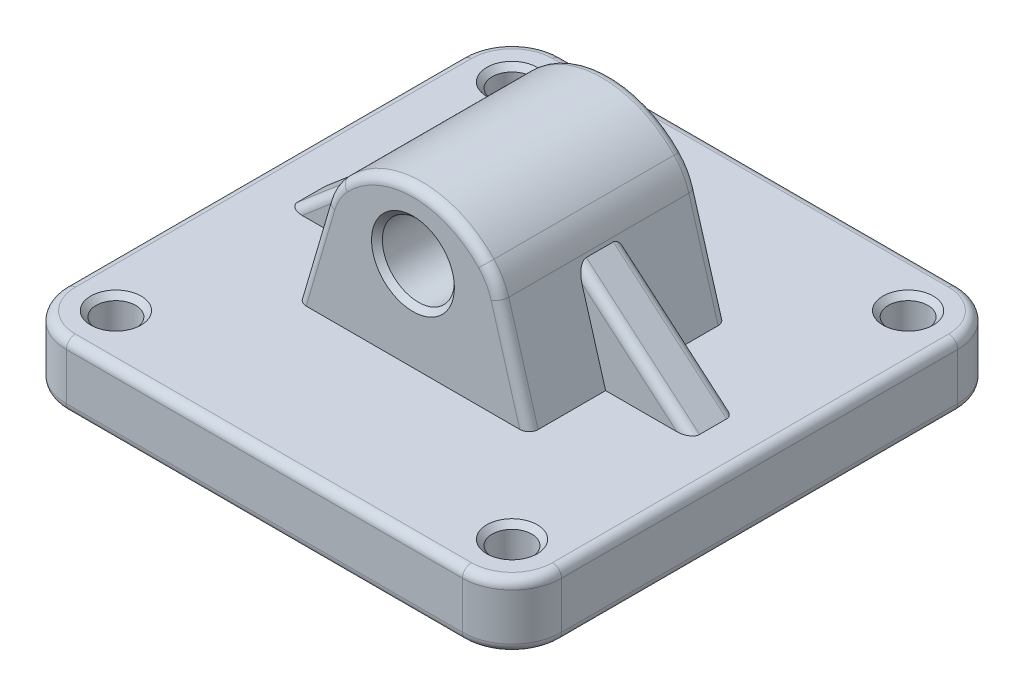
ISO-10303-21;
HEADER;
FILE_DESCRIPTION(('STEP AP214'),'2;1');
FILE_NAME('part.step','',(''),(''),'','','');
FILE_SCHEMA(('AUTOMOTIVE_DESIGN { 1 0 10303 214 1 1 1 1 }'));
ENDSEC;
DATA;
#1=APPLICATION_CONTEXT('core data for automotive mechanical design processes');
#2=APPLICATION_PROTOCOL_DEFINITION('international standard','automotive_design',2000,#1);
#3=PRODUCT_CONTEXT('',#1,'mechanical');
#4=PRODUCT('Part','Part','',(#3));
#5=PRODUCT_RELATED_PRODUCT_CATEGORY('part','',(#4));
#6=PRODUCT_DEFINITION_FORMATION('','',#4);
#7=PRODUCT_DEFINITION_CONTEXT('part definition',#1,'design');
#8=PRODUCT_DEFINITION('design','',#6,#7);
#9=PRODUCT_DEFINITION_SHAPE('','',#8);
#10=(LENGTH_UNIT() NAMED_UNIT(*) SI_UNIT(.MILLI.,.METRE.));
#11=(NAMED_UNIT(*) PLANE_ANGLE_UNIT() SI_UNIT($,.RADIAN.));
#12=(NAMED_UNIT(*) SI_UNIT($,.STERADIAN.) SOLID_ANGLE_UNIT());
#13=UNCERTAINTY_MEASURE_WITH_UNIT(LENGTH_MEASURE(1.E-05),#10,'distance_accuracy_value','');
#14=(GEOMETRIC_REPRESENTATION_CONTEXT(3) GLOBAL_UNCERTAINTY_ASSIGNED_CONTEXT((#13)) GLOBAL_UNIT_ASSIGNED_CONTEXT((#10,
#11,#12)) REPRESENTATION_CONTEXT('',''));
#15=CARTESIAN_POINT('',(0.,0.,0.));
#16=DIRECTION('',(0.,0.,1.));
#17=DIRECTION('',(1.,0.,0.));
#18=AXIS2_PLACEMENT_3D('',#15,#16,#17);
#19=CARTESIAN_POINT('',(-110.,36.,-110.));
#20=DIRECTION('',(0.,1.,0.));
#21=DIRECTION('',(0.,0.,1.));
#22=AXIS2_PLACEMENT_3D('',#19,#20,#21);
#23=PLANE('',#22);
#24=CARTESIAN_POINT('',(110.,36.,110.));
#25=DIRECTION('',(0.,1.,0.));
#26=DIRECTION('',(0.,0.,1.));
#27=AXIS2_PLACEMENT_3D('',#24,#25,#26);
#28=CIRCLE('',#27,14.);
#29=CARTESIAN_POINT('',(110.,36.,124.));
#30=VERTEX_POINT('',#29);
#31=EDGE_CURVE('E11',#30,#30,#28,.F.);
#32=ORIENTED_EDGE('',*,*,#31,.T.);
#33=EDGE_LOOP('',(#32));
#34=FACE_BOUND('',#33,.T.);
#35=CARTESIAN_POINT('',(110.,36.,-110.));
#36=DIRECTION('',(0.,1.,0.));
#37=DIRECTION('',(0.,0.,1.));
#38=AXIS2_PLACEMENT_3D('',#35,#36,#37);
#39=CIRCLE('',#38,14.);
#40=CARTESIAN_POINT('',(110.,36.,-96.));
#41=VERTEX_POINT('',#40);
#42=EDGE_CURVE('E45',#41,#41,#39,.F.);
#43=ORIENTED_EDGE('',*,*,#42,.T.);
#44=EDGE_LOOP('',(#43));
#45=FACE_BOUND('',#44,.T.);
#46=CARTESIAN_POINT('',(-110.,36.,-110.));
#47=DIRECTION('',(0.,1.,0.));
#48=DIRECTION('',(0.,0.,1.));
#49=AXIS2_PLACEMENT_3D('',#46,#47,#48);
#50=CIRCLE('',#49,14.);
#51=CARTESIAN_POINT('',(-110.,36.,-96.));
#52=VERTEX_POINT('',#51);
#53=EDGE_CURVE('E652',#52,#52,#50,.F.);
#54=ORIENTED_EDGE('',*,*,#53,.T.);
#55=EDGE_LOOP('',(#54));
#56=FACE_BOUND('',#55,.T.);
#57=CARTESIAN_POINT('',(-110.,36.,110.));
#58=DIRECTION('',(0.,1.,0.));
#59=DIRECTION('',(0.,0.,1.));
#60=AXIS2_PLACEMENT_3D('',#57,#58,#59);
#61=CIRCLE('',#60,14.);
#62=CARTESIAN_POINT('',(-110.,36.,124.));
#63=VERTEX_POINT('',#62);
#64=EDGE_CURVE('E649',#63,#63,#61,.F.);
#65=ORIENTED_EDGE('',*,*,#64,.T.);
#66=EDGE_LOOP('',(#65));
#67=FACE_BOUND('',#66,.T.);
#68=DIRECTION('',(-1.,0.,0.));
#69=VECTOR('',#68,1.);
#70=CARTESIAN_POINT('',(-110.,36.,-132.5));
#71=LINE('',#70,#69);
#72=CARTESIAN_POINT('',(110.,36.,-132.5));
#73=VERTEX_POINT('',#72);
#74=CARTESIAN_POINT('',(-110.,36.,-132.5));
#75=VERTEX_POINT('',#74);
#76=EDGE_CURVE('E52',#73,#75,#71,.T.);
#77=ORIENTED_EDGE('',*,*,#76,.T.);
#78=CARTESIAN_POINT('',(-110.,36.,-110.));
#79=DIRECTION('',(0.,1.,0.));
#80=DIRECTION('',(0.,0.,1.));
#81=AXIS2_PLACEMENT_3D('',#78,#79,#80);
#82=CIRCLE('',#81,22.5000000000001);
#83=CARTESIAN_POINT('',(-132.5,36.,-110.));
#84=VERTEX_POINT('',#83);
#85=EDGE_CURVE('E487',#75,#84,#82,.T.);
#86=ORIENTED_EDGE('',*,*,#85,.T.);
#87=DIRECTION('',(0.,0.,1.));
#88=VECTOR('',#87,1.);
#89=CARTESIAN_POINT('',(-132.5,36.,110.));
#90=LINE('',#89,#88);
#91=CARTESIAN_POINT('',(-132.5,36.,110.));
#92=VERTEX_POINT('',#91);
#93=EDGE_CURVE('E475',#84,#92,#90,.T.);
#94=ORIENTED_EDGE('',*,*,#93,.T.);
#95=CARTESIAN_POINT('',(-110.,36.,110.));
#96=DIRECTION('',(0.,1.,0.));
#97=DIRECTION('',(0.,0.,1.));
#98=AXIS2_PLACEMENT_3D('',#95,#96,#97);
#99=CIRCLE('',#98,22.5000000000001);
#100=CARTESIAN_POINT('',(-110.,36.,132.5));
#101=VERTEX_POINT('',#100);
#102=EDGE_CURVE('E477',#92,#101,#99,.T.);
#103=ORIENTED_EDGE('',*,*,#102,.T.);
#104=DIRECTION('',(1.,0.,0.));
#105=VECTOR('',#104,1.);
#106=CARTESIAN_POINT('',(110.,36.,132.5));
#107=LINE('',#106,#105);
#108=CARTESIAN_POINT('',(110.,36.,132.5));
#109=VERTEX_POINT('',#108);
#110=EDGE_CURVE('E479',#101,#109,#107,.T.);
#111=ORIENTED_EDGE('',*,*,#110,.T.);
#112=CARTESIAN_POINT('',(110.,36.,110.));
#113=DIRECTION('',(0.,1.,0.));
#114=DIRECTION('',(0.,0.,1.));
#115=AXIS2_PLACEMENT_3D('',#112,#113,#114);
#116=CIRCLE('',#115,22.5);
#117=CARTESIAN_POINT('',(132.5,36.,110.));
#118=VERTEX_POINT('',#117);
#119=EDGE_CURVE('E481',#109,#118,#116,.T.);
#120=ORIENTED_EDGE('',*,*,#119,.T.);
#121=DIRECTION('',(0.,0.,-1.));
#122=VECTOR('',#121,1.);
#123=CARTESIAN_POINT('',(132.5,36.,-110.));
#124=LINE('',#123,#122);
#125=CARTESIAN_POINT('',(132.5,36.,-110.));
#126=VERTEX_POINT('',#125);
#127=EDGE_CURVE('E483',#118,#126,#124,.T.);
#128=ORIENTED_EDGE('',*,*,#127,.T.);
#129=CARTESIAN_POINT('',(110.,36.,-110.));
#130=DIRECTION('',(0.,1.,0.));
#131=DIRECTION('',(0.,0.,1.));
#132=AXIS2_PLACEMENT_3D('',#129,#130,#131);
#133=CIRCLE('',#132,22.5);
#134=EDGE_CURVE('E57',#126,#73,#133,.T.);
#135=ORIENTED_EDGE('',*,*,#134,.T.);
#136=EDGE_LOOP('',(#77,#86,#94,#103,#111,#120,#128,#135));
#137=FACE_BOUND('',#136,.T.);
#138=DIRECTION('',(0.,0.,1.));
#139=VECTOR('',#138,1.);
#140=CARTESIAN_POINT('',(111.685532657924,36.,-110.));
#141=LINE('',#140,#139);
#142=CARTESIAN_POINT('',(111.685532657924,36.,7.50000000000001));
#143=VERTEX_POINT('',#142);
#144=CARTESIAN_POINT('',(111.685532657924,36.,-7.50000000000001));
#145=VERTEX_POINT('',#144);
#146=EDGE_CURVE('E338',#143,#145,#141,.F.);
#147=ORIENTED_EDGE('',*,*,#146,.F.);
#148=CARTESIAN_POINT('',(103.980747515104,36.,7.5));
#149=DIRECTION('',(0.,1.,0.));
#150=DIRECTION('',(-1.,0.,0.));
#151=AXIS2_PLACEMENT_3D('',#148,#149,#150);
#152=ELLIPSE('',#151,7.70478514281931,5.);
#153=CARTESIAN_POINT('',(103.980747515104,36.,12.5));
#154=VERTEX_POINT('',#153);
#155=EDGE_CURVE('E528',#143,#154,#152,.F.);
#156=ORIENTED_EDGE('',*,*,#155,.T.);
#157=DIRECTION('',(1.,0.,0.));
#158=VECTOR('',#157,1.);
#159=CARTESIAN_POINT('',(-110.,36.,12.5));
#160=LINE('',#159,#158);
#161=CARTESIAN_POINT('',(64.5,36.,12.5));
#162=VERTEX_POINT('',#161);
#163=EDGE_CURVE('E331',#162,#154,#160,.T.);
#164=ORIENTED_EDGE('',*,*,#163,.F.);
#165=DIRECTION('',(0.,0.,1.));
#166=VECTOR('',#165,1.);
#167=CARTESIAN_POINT('',(64.5,36.,-55.));
#168=LINE('',#167,#166);
#169=CARTESIAN_POINT('',(64.5,36.,50.));
#170=VERTEX_POINT('',#169);
#171=EDGE_CURVE('E303',#162,#170,#168,.T.);
#172=ORIENTED_EDGE('',*,*,#171,.T.);
#173=CARTESIAN_POINT('',(59.2896506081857,36.,50.));
#174=DIRECTION('',(0.,1.,0.));
#175=DIRECTION('',(-1.,0.,0.));
#176=AXIS2_PLACEMENT_3D('',#173,#174,#175);
#177=ELLIPSE('',#176,5.21034939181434,5.);
#178=CARTESIAN_POINT('',(59.2896506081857,36.,55.));
#179=VERTEX_POINT('',#178);
#180=EDGE_CURVE('E516',#170,#179,#177,.F.);
#181=ORIENTED_EDGE('',*,*,#180,.T.);
#182=DIRECTION('',(1.,0.,0.));
#183=VECTOR('',#182,1.);
#184=CARTESIAN_POINT('',(-64.5,36.,55.));
#185=LINE('',#184,#183);
#186=CARTESIAN_POINT('',(-59.2896506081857,36.,55.));
#187=VERTEX_POINT('',#186);
#188=EDGE_CURVE('E341',#187,#179,#185,.T.);
#189=ORIENTED_EDGE('',*,*,#188,.F.);
#190=CARTESIAN_POINT('',(-59.2896506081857,36.,50.));
#191=DIRECTION('',(0.,1.,0.));
#192=DIRECTION('',(-1.,0.,0.));
#193=AXIS2_PLACEMENT_3D('',#190,#191,#192);
#194=ELLIPSE('',#193,5.21034939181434,5.);
#195=CARTESIAN_POINT('',(-64.5,36.,50.));
#196=VERTEX_POINT('',#195);
#197=EDGE_CURVE('E518',#187,#196,#194,.F.);
#198=ORIENTED_EDGE('',*,*,#197,.T.);
#199=DIRECTION('',(0.,0.,1.));
#200=VECTOR('',#199,1.);
#201=CARTESIAN_POINT('',(-64.5,36.,-55.));
#202=LINE('',#201,#200);
#203=CARTESIAN_POINT('',(-64.5,36.,12.5));
#204=VERTEX_POINT('',#203);
#205=EDGE_CURVE('E304',#204,#196,#202,.T.);
#206=ORIENTED_EDGE('',*,*,#205,.F.);
#207=DIRECTION('',(1.,0.,0.));
#208=VECTOR('',#207,1.);
#209=CARTESIAN_POINT('',(-110.,36.,12.5));
#210=LINE('',#209,#208);
#211=CARTESIAN_POINT('',(-103.980747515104,36.,12.5));
#212=VERTEX_POINT('',#211);
#213=EDGE_CURVE('E314',#212,#204,#210,.T.);
#214=ORIENTED_EDGE('',*,*,#213,.F.);
#215=CARTESIAN_POINT('',(-103.980747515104,36.,7.5));
#216=DIRECTION('',(0.,1.,0.));
#217=DIRECTION('',(-1.,0.,0.));
#218=AXIS2_PLACEMENT_3D('',#215,#216,#217);
#219=ELLIPSE('',#218,7.70478514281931,5.);
#220=CARTESIAN_POINT('',(-111.685532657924,36.,7.50000000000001));
#221=VERTEX_POINT('',#220);
#222=EDGE_CURVE('E535',#212,#221,#219,.F.);
#223=ORIENTED_EDGE('',*,*,#222,.T.);
#224=DIRECTION('',(0.,0.,1.));
#225=VECTOR('',#224,1.);
#226=CARTESIAN_POINT('',(-111.685532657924,36.,-110.));
#227=LINE('',#226,#225);
#228=CARTESIAN_POINT('',(-111.685532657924,36.,-7.50000000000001));
#229=VERTEX_POINT('',#228);
#230=EDGE_CURVE('E321',#229,#221,#227,.T.);
#231=ORIENTED_EDGE('',*,*,#230,.F.);
#232=CARTESIAN_POINT('',(-103.980747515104,36.,-7.5));
#233=DIRECTION('',(0.,1.,0.));
#234=DIRECTION('',(1.,0.,0.));
#235=AXIS2_PLACEMENT_3D('',#232,#233,#234);
#236=ELLIPSE('',#235,7.70478514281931,5.);
#237=CARTESIAN_POINT('',(-103.980747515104,36.,-12.5));
#238=VERTEX_POINT('',#237);
#239=EDGE_CURVE('E288',#229,#238,#236,.F.);
#240=ORIENTED_EDGE('',*,*,#239,.T.);
#241=DIRECTION('',(1.,0.,0.));
#242=VECTOR('',#241,1.);
#243=CARTESIAN_POINT('',(-110.,36.,-12.5));
#244=LINE('',#243,#242);
#245=CARTESIAN_POINT('',(-64.5,36.,-12.5));
#246=VERTEX_POINT('',#245);
#247=EDGE_CURVE('E282',#238,#246,#244,.T.);
#248=ORIENTED_EDGE('',*,*,#247,.T.);
#249=CARTESIAN_POINT('',(-64.5,36.,-50.));
#250=VERTEX_POINT('',#249);
#251=EDGE_CURVE('E285',#250,#246,#202,.T.);
#252=ORIENTED_EDGE('',*,*,#251,.F.);
#253=CARTESIAN_POINT('',(-59.2896506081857,36.,-50.));
#254=DIRECTION('',(0.,1.,0.));
#255=DIRECTION('',(1.,0.,0.));
#256=AXIS2_PLACEMENT_3D('',#253,#254,#255);
#257=ELLIPSE('',#256,5.21034939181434,5.);
#258=CARTESIAN_POINT('',(-59.2896506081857,36.,-55.));
#259=VERTEX_POINT('',#258);
#260=EDGE_CURVE('E522',#250,#259,#257,.F.);
#261=ORIENTED_EDGE('',*,*,#260,.T.);
#262=DIRECTION('',(1.,0.,0.));
#263=VECTOR('',#262,1.);
#264=CARTESIAN_POINT('',(-64.5,36.,-55.));
#265=LINE('',#264,#263);
#266=CARTESIAN_POINT('',(59.2896506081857,36.,-55.));
#267=VERTEX_POINT('',#266);
#268=EDGE_CURVE('E342',#259,#267,#265,.T.);
#269=ORIENTED_EDGE('',*,*,#268,.T.);
#270=CARTESIAN_POINT('',(59.2896506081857,36.,-50.));
#271=DIRECTION('',(0.,1.,0.));
#272=DIRECTION('',(1.,0.,0.));
#273=AXIS2_PLACEMENT_3D('',#270,#271,#272);
#274=ELLIPSE('',#273,5.21034939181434,5.);
#275=CARTESIAN_POINT('',(64.5,36.,-50.));
#276=VERTEX_POINT('',#275);
#277=EDGE_CURVE('E520',#267,#276,#274,.F.);
#278=ORIENTED_EDGE('',*,*,#277,.T.);
#279=CARTESIAN_POINT('',(64.5,36.,-12.5));
#280=VERTEX_POINT('',#279);
#281=EDGE_CURVE('E348',#276,#280,#168,.T.);
#282=ORIENTED_EDGE('',*,*,#281,.T.);
#283=DIRECTION('',(1.,0.,0.));
#284=VECTOR('',#283,1.);
#285=CARTESIAN_POINT('',(-110.,36.,-12.5));
#286=LINE('',#285,#284);
#287=CARTESIAN_POINT('',(103.980747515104,36.,-12.5));
#288=VERTEX_POINT('',#287);
#289=EDGE_CURVE('E325',#280,#288,#286,.T.);
#290=ORIENTED_EDGE('',*,*,#289,.T.);
#291=CARTESIAN_POINT('',(103.980747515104,36.,-7.5));
#292=DIRECTION('',(0.,1.,0.));
#293=DIRECTION('',(1.,0.,0.));
#294=AXIS2_PLACEMENT_3D('',#291,#292,#293);
#295=ELLIPSE('',#294,7.70478514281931,5.);
#296=EDGE_CURVE('E524',#288,#145,#295,.F.);
#297=ORIENTED_EDGE('',*,*,#296,.T.);
#298=EDGE_LOOP('',(#147,#156,#164,#172,#181,#189,#198,#206,#214,#223,#231,#240,#248,#252,#261,
#269,#278,#282,#290,#297));
#299=FACE_BOUND('',#298,.T.);
#300=ADVANCED_FACE('F37',(#34,#45,#56,#67,#137,#299),#23,.T.);
#301=CARTESIAN_POINT('',(-110.,0.,-110.));
#302=DIRECTION('',(0.,1.,0.));
#303=DIRECTION('',(0.,0.,1.));
#304=AXIS2_PLACEMENT_3D('',#301,#302,#303);
#305=PLANE('',#304);
#306=CARTESIAN_POINT('',(-110.,0.,-110.));
#307=DIRECTION('',(0.,1.,0.));
#308=DIRECTION('',(0.,0.,1.));
#309=AXIS2_PLACEMENT_3D('',#306,#307,#308);
#310=CIRCLE('',#309,14.);
#311=CARTESIAN_POINT('',(-110.,0.,-96.));
#312=VERTEX_POINT('',#311);
#313=EDGE_CURVE('E610',#312,#312,#310,.T.);
#314=ORIENTED_EDGE('',*,*,#313,.T.);
#315=EDGE_LOOP('',(#314));
#316=FACE_BOUND('',#315,.T.);
#317=CARTESIAN_POINT('',(-110.,0.,110.));
#318=DIRECTION('',(0.,1.,0.));
#319=DIRECTION('',(0.,0.,1.));
#320=AXIS2_PLACEMENT_3D('',#317,#318,#319);
#321=CIRCLE('',#320,14.);
#322=CARTESIAN_POINT('',(-110.,0.,124.));
#323=VERTEX_POINT('',#322);
#324=EDGE_CURVE('E607',#323,#323,#321,.T.);
#325=ORIENTED_EDGE('',*,*,#324,.T.);
#326=EDGE_LOOP('',(#325));
#327=FACE_BOUND('',#326,.T.);
#328=CARTESIAN_POINT('',(110.,0.,110.));
#329=DIRECTION('',(0.,1.,0.));
#330=DIRECTION('',(0.,0.,1.));
#331=AXIS2_PLACEMENT_3D('',#328,#329,#330);
#332=CIRCLE('',#331,14.);
#333=CARTESIAN_POINT('',(110.,0.,124.));
#334=VERTEX_POINT('',#333);
#335=EDGE_CURVE('E604',#334,#334,#332,.T.);
#336=ORIENTED_EDGE('',*,*,#335,.T.);
#337=EDGE_LOOP('',(#336));
#338=FACE_BOUND('',#337,.T.);
#339=CARTESIAN_POINT('',(110.,0.,-110.));
#340=DIRECTION('',(0.,1.,0.));
#341=DIRECTION('',(0.,0.,1.));
#342=AXIS2_PLACEMENT_3D('',#339,#340,#341);
#343=CIRCLE('',#342,14.);
#344=CARTESIAN_POINT('',(110.,0.,-96.));
#345=VERTEX_POINT('',#344);
#346=EDGE_CURVE('E539',#345,#345,#343,.T.);
#347=ORIENTED_EDGE('',*,*,#346,.T.);
#348=EDGE_LOOP('',(#347));
#349=FACE_BOUND('',#348,.T.);
#350=DIRECTION('',(1.,0.,0.));
#351=VECTOR('',#350,1.);
#352=CARTESIAN_POINT('',(-110.,0.,132.5));
#353=LINE('',#352,#351);
#354=CARTESIAN_POINT('',(110.,0.,132.5));
#355=VERTEX_POINT('',#354);
#356=CARTESIAN_POINT('',(-110.,0.,132.5));
#357=VERTEX_POINT('',#356);
#358=EDGE_CURVE('E433',#355,#357,#353,.F.);
#359=ORIENTED_EDGE('',*,*,#358,.T.);
#360=CARTESIAN_POINT('',(-110.,0.,110.));
#361=DIRECTION('',(0.,1.,0.));
#362=DIRECTION('',(0.,0.,1.));
#363=AXIS2_PLACEMENT_3D('',#360,#361,#362);
#364=CIRCLE('',#363,22.5000000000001);
#365=CARTESIAN_POINT('',(-132.5,0.,110.));
#366=VERTEX_POINT('',#365);
#367=EDGE_CURVE('E447',#357,#366,#364,.F.);
#368=ORIENTED_EDGE('',*,*,#367,.T.);
#369=DIRECTION('',(0.,0.,1.));
#370=VECTOR('',#369,1.);
#371=CARTESIAN_POINT('',(-132.5,0.,-110.));
#372=LINE('',#371,#370);
#373=CARTESIAN_POINT('',(-132.5,0.,-110.));
#374=VERTEX_POINT('',#373);
#375=EDGE_CURVE('E445',#366,#374,#372,.F.);
#376=ORIENTED_EDGE('',*,*,#375,.T.);
#377=CARTESIAN_POINT('',(-110.,0.,-110.));
#378=DIRECTION('',(0.,1.,0.));
#379=DIRECTION('',(0.,0.,1.));
#380=AXIS2_PLACEMENT_3D('',#377,#378,#379);
#381=CIRCLE('',#380,22.5000000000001);
#382=CARTESIAN_POINT('',(-110.,0.,-132.5));
#383=VERTEX_POINT('',#382);
#384=EDGE_CURVE('E443',#374,#383,#381,.F.);
#385=ORIENTED_EDGE('',*,*,#384,.T.);
#386=DIRECTION('',(-1.,0.,0.));
#387=VECTOR('',#386,1.);
#388=CARTESIAN_POINT('',(-110.,0.,-132.5));
#389=LINE('',#388,#387);
#390=CARTESIAN_POINT('',(110.,0.,-132.5));
#391=VERTEX_POINT('',#390);
#392=EDGE_CURVE('E441',#383,#391,#389,.F.);
#393=ORIENTED_EDGE('',*,*,#392,.T.);
#394=CARTESIAN_POINT('',(110.,0.,-110.));
#395=DIRECTION('',(0.,1.,0.));
#396=DIRECTION('',(0.,0.,1.));
#397=AXIS2_PLACEMENT_3D('',#394,#395,#396);
#398=CIRCLE('',#397,22.5);
#399=CARTESIAN_POINT('',(132.5,0.,-110.));
#400=VERTEX_POINT('',#399);
#401=EDGE_CURVE('E439',#391,#400,#398,.F.);
#402=ORIENTED_EDGE('',*,*,#401,.T.);
#403=DIRECTION('',(0.,0.,-1.));
#404=VECTOR('',#403,1.);
#405=CARTESIAN_POINT('',(132.5,0.,-110.));
#406=LINE('',#405,#404);
#407=CARTESIAN_POINT('',(132.5,0.,110.));
#408=VERTEX_POINT('',#407);
#409=EDGE_CURVE('E437',#400,#408,#406,.F.);
#410=ORIENTED_EDGE('',*,*,#409,.T.);
#411=CARTESIAN_POINT('',(110.,0.,110.));
#412=DIRECTION('',(0.,1.,0.));
#413=DIRECTION('',(0.,0.,1.));
#414=AXIS2_PLACEMENT_3D('',#411,#412,#413);
#415=CIRCLE('',#414,22.5);
#416=EDGE_CURVE('E435',#408,#355,#415,.F.);
#417=ORIENTED_EDGE('',*,*,#416,.T.);
#418=EDGE_LOOP('',(#359,#368,#376,#385,#393,#402,#410,#417));
#419=FACE_BOUND('',#418,.T.);
#420=CARTESIAN_POINT('',(0.,0.,0.));
#421=DIRECTION('',(0.,-1.,0.));
#422=DIRECTION('',(0.,0.,-1.));
#423=AXIS2_PLACEMENT_3D('',#420,#421,#422);
#424=CIRCLE('',#423,105.);
#425=CARTESIAN_POINT('',(0.,0.,-105.));
#426=VERTEX_POINT('',#425);
#427=EDGE_CURVE('E349',#426,#426,#424,.T.);
#428=ORIENTED_EDGE('',*,*,#427,.F.);
#429=EDGE_LOOP('',(#428));
#430=FACE_BOUND('',#429,.T.);
#431=ADVANCED_FACE('F684',(#316,#327,#338,#349,#419,#430),#305,.F.);
#432=CARTESIAN_POINT('',(-110.,36.,-110.));
#433=DIRECTION('',(0.,-1.,0.));
#434=DIRECTION('',(0.,0.,-1.));
#435=AXIS2_PLACEMENT_3D('',#432,#433,#434);
#436=CYLINDRICAL_SURFACE('',#435,27.5000000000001);
#437=DIRECTION('',(0.,-1.,0.));
#438=VECTOR('',#437,1.);
#439=CARTESIAN_POINT('',(-110.,36.,-137.5));
#440=LINE('',#439,#438);
#441=CARTESIAN_POINT('',(-110.,31.,-137.5));
#442=VERTEX_POINT('',#441);
#443=CARTESIAN_POINT('',(-110.,5.,-137.5));
#444=VERTEX_POINT('',#443);
#445=EDGE_CURVE('E367',#442,#444,#440,.T.);
#446=ORIENTED_EDGE('',*,*,#445,.T.);
#447=CARTESIAN_POINT('',(-110.,5.,-110.));
#448=DIRECTION('',(0.,1.,0.));
#449=DIRECTION('',(0.,0.,1.));
#450=AXIS2_PLACEMENT_3D('',#447,#448,#449);
#451=CIRCLE('',#450,27.5000000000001);
#452=CARTESIAN_POINT('',(-137.5,5.,-110.));
#453=VERTEX_POINT('',#452);
#454=EDGE_CURVE('E457',#444,#453,#451,.T.);
#455=ORIENTED_EDGE('',*,*,#454,.T.);
#456=DIRECTION('',(0.,-1.,0.));
#457=VECTOR('',#456,1.);
#458=CARTESIAN_POINT('',(-137.5,36.,-110.));
#459=LINE('',#458,#457);
#460=CARTESIAN_POINT('',(-137.5,31.,-110.));
#461=VERTEX_POINT('',#460);
#462=EDGE_CURVE('E388',#461,#453,#459,.T.);
#463=ORIENTED_EDGE('',*,*,#462,.F.);
#464=CARTESIAN_POINT('',(-110.,31.,-110.));
#465=DIRECTION('',(0.,1.,0.));
#466=DIRECTION('',(0.,0.,1.));
#467=AXIS2_PLACEMENT_3D('',#464,#465,#466);
#468=CIRCLE('',#467,27.5000000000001);
#469=EDGE_CURVE('E454',#461,#442,#468,.F.);
#470=ORIENTED_EDGE('',*,*,#469,.T.);
#471=EDGE_LOOP('',(#446,#455,#463,#470));
#472=FACE_BOUND('',#471,.T.);
#473=ADVANCED_FACE('F691',(#472),#436,.T.);
#474=CARTESIAN_POINT('',(-137.5,36.,-110.));
#475=DIRECTION('',(1.,0.,0.));
#476=DIRECTION('',(0.,0.,-1.));
#477=AXIS2_PLACEMENT_3D('',#474,#475,#476);
#478=PLANE('',#477);
#479=ORIENTED_EDGE('',*,*,#462,.T.);
#480=DIRECTION('',(0.,0.,1.));
#481=VECTOR('',#480,1.);
#482=CARTESIAN_POINT('',(-137.5,5.,-110.));
#483=LINE('',#482,#481);
#484=CARTESIAN_POINT('',(-137.5,5.,110.));
#485=VERTEX_POINT('',#484);
#486=EDGE_CURVE('E452',#453,#485,#483,.T.);
#487=ORIENTED_EDGE('',*,*,#486,.T.);
#488=DIRECTION('',(0.,-1.,0.));
#489=VECTOR('',#488,1.);
#490=CARTESIAN_POINT('',(-137.5,36.,110.));
#491=LINE('',#490,#489);
#492=CARTESIAN_POINT('',(-137.5,31.,110.));
#493=VERTEX_POINT('',#492);
#494=EDGE_CURVE('E385',#493,#485,#491,.T.);
#495=ORIENTED_EDGE('',*,*,#494,.F.);
#496=DIRECTION('',(0.,0.,1.));
#497=VECTOR('',#496,1.);
#498=CARTESIAN_POINT('',(-137.5,31.,-110.));
#499=LINE('',#498,#497);
#500=EDGE_CURVE('E450',#493,#461,#499,.F.);
#501=ORIENTED_EDGE('',*,*,#500,.T.);
#502=EDGE_LOOP('',(#479,#487,#495,#501));
#503=FACE_BOUND('',#502,.T.);
#504=ADVANCED_FACE('F717',(#503),#478,.F.);
#505=CARTESIAN_POINT('',(-110.,36.,110.));
#506=DIRECTION('',(0.,-1.,0.));
#507=DIRECTION('',(0.,0.,-1.));
#508=AXIS2_PLACEMENT_3D('',#505,#506,#507);
#509=CYLINDRICAL_SURFACE('',#508,27.5000000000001);
#510=ORIENTED_EDGE('',*,*,#494,.T.);
#511=CARTESIAN_POINT('',(-110.,5.,110.));
#512=DIRECTION('',(0.,1.,0.));
#513=DIRECTION('',(0.,0.,1.));
#514=AXIS2_PLACEMENT_3D('',#511,#512,#513);
#515=CIRCLE('',#514,27.5000000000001);
#516=CARTESIAN_POINT('',(-110.,5.,137.5));
#517=VERTEX_POINT('',#516);
#518=EDGE_CURVE('E430',#485,#517,#515,.T.);
#519=ORIENTED_EDGE('',*,*,#518,.T.);
#520=DIRECTION('',(0.,-1.,0.));
#521=VECTOR('',#520,1.);
#522=CARTESIAN_POINT('',(-110.,36.,137.5));
#523=LINE('',#522,#521);
#524=CARTESIAN_POINT('',(-110.,31.,137.5));
#525=VERTEX_POINT('',#524);
#526=EDGE_CURVE('E382',#525,#517,#523,.T.);
#527=ORIENTED_EDGE('',*,*,#526,.F.);
#528=CARTESIAN_POINT('',(-110.,31.,110.));
#529=DIRECTION('',(0.,1.,0.));
#530=DIRECTION('',(0.,0.,1.));
#531=AXIS2_PLACEMENT_3D('',#528,#529,#530);
#532=CIRCLE('',#531,27.5000000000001);
#533=EDGE_CURVE('E428',#525,#493,#532,.F.);
#534=ORIENTED_EDGE('',*,*,#533,.T.);
#535=EDGE_LOOP('',(#510,#519,#527,#534));
#536=FACE_BOUND('',#535,.T.);
#537=ADVANCED_FACE('F713',(#536),#509,.T.);
#538=CARTESIAN_POINT('',(-110.,36.,137.5));
#539=DIRECTION('',(0.,0.,-1.));
#540=DIRECTION('',(-1.,0.,0.));
#541=AXIS2_PLACEMENT_3D('',#538,#539,#540);
#542=PLANE('',#541);
#543=DIRECTION('',(0.,-1.,0.));
#544=VECTOR('',#543,1.);
#545=CARTESIAN_POINT('',(110.,36.,137.5));
#546=LINE('',#545,#544);
#547=CARTESIAN_POINT('',(110.,31.,137.5));
#548=VERTEX_POINT('',#547);
#549=CARTESIAN_POINT('',(110.,5.,137.5));
#550=VERTEX_POINT('',#549);
#551=EDGE_CURVE('E379',#548,#550,#546,.T.);
#552=ORIENTED_EDGE('',*,*,#551,.F.);
#553=DIRECTION('',(1.,0.,0.));
#554=VECTOR('',#553,1.);
#555=CARTESIAN_POINT('',(-110.,31.,137.5));
#556=LINE('',#555,#554);
#557=EDGE_CURVE('E491',#548,#525,#556,.F.);
#558=ORIENTED_EDGE('',*,*,#557,.T.);
#559=ORIENTED_EDGE('',*,*,#526,.T.);
#560=DIRECTION('',(1.,0.,0.));
#561=VECTOR('',#560,1.);
#562=CARTESIAN_POINT('',(-110.,5.,137.5));
#563=LINE('',#562,#561);
#564=EDGE_CURVE('E489',#517,#550,#563,.T.);
#565=ORIENTED_EDGE('',*,*,#564,.T.);
#566=EDGE_LOOP('',(#552,#558,#559,#565));
#567=FACE_BOUND('',#566,.T.);
#568=ADVANCED_FACE('F709',(#567),#542,.F.);
#569=CARTESIAN_POINT('',(110.,36.,110.));
#570=DIRECTION('',(0.,-1.,0.));
#571=DIRECTION('',(0.,0.,-1.));
#572=AXIS2_PLACEMENT_3D('',#569,#570,#571);
#573=CYLINDRICAL_SURFACE('',#572,27.5000000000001);
#574=ORIENTED_EDGE('',*,*,#551,.T.);
#575=CARTESIAN_POINT('',(110.,5.,110.));
#576=DIRECTION('',(0.,1.,0.));
#577=DIRECTION('',(0.,0.,1.));
#578=AXIS2_PLACEMENT_3D('',#575,#576,#577);
#579=CIRCLE('',#578,27.5000000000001);
#580=CARTESIAN_POINT('',(137.5,5.,110.));
#581=VERTEX_POINT('',#580);
#582=EDGE_CURVE('E473',#550,#581,#579,.T.);
#583=ORIENTED_EDGE('',*,*,#582,.T.);
#584=DIRECTION('',(0.,-1.,0.));
#585=VECTOR('',#584,1.);
#586=CARTESIAN_POINT('',(137.5,36.,110.));
#587=LINE('',#586,#585);
#588=CARTESIAN_POINT('',(137.5,31.,110.));
#589=VERTEX_POINT('',#588);
#590=EDGE_CURVE('E376',#589,#581,#587,.T.);
#591=ORIENTED_EDGE('',*,*,#590,.F.);
#592=CARTESIAN_POINT('',(110.,31.,110.));
#593=DIRECTION('',(0.,1.,0.));
#594=DIRECTION('',(0.,0.,1.));
#595=AXIS2_PLACEMENT_3D('',#592,#593,#594);
#596=CIRCLE('',#595,27.5000000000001);
#597=EDGE_CURVE('E471',#589,#548,#596,.F.);
#598=ORIENTED_EDGE('',*,*,#597,.T.);
#599=EDGE_LOOP('',(#574,#583,#591,#598));
#600=FACE_BOUND('',#599,.T.);
#601=ADVANCED_FACE('F705',(#600),#573,.T.);
#602=CARTESIAN_POINT('',(137.5,36.,-110.));
#603=DIRECTION('',(-1.,0.,0.));
#604=DIRECTION('',(0.,0.,1.));
#605=AXIS2_PLACEMENT_3D('',#602,#603,#604);
#606=PLANE('',#605);
#607=ORIENTED_EDGE('',*,*,#590,.T.);
#608=DIRECTION('',(0.,0.,-1.));
#609=VECTOR('',#608,1.);
#610=CARTESIAN_POINT('',(137.5,5.,-110.));
#611=LINE('',#610,#609);
#612=CARTESIAN_POINT('',(137.5,5.,-110.));
#613=VERTEX_POINT('',#612);
#614=EDGE_CURVE('E469',#581,#613,#611,.T.);
#615=ORIENTED_EDGE('',*,*,#614,.T.);
#616=DIRECTION('',(0.,-1.,0.));
#617=VECTOR('',#616,1.);
#618=CARTESIAN_POINT('',(137.5,36.,-110.));
#619=LINE('',#618,#617);
#620=CARTESIAN_POINT('',(137.5,31.,-110.));
#621=VERTEX_POINT('',#620);
#622=EDGE_CURVE('E373',#621,#613,#619,.T.);
#623=ORIENTED_EDGE('',*,*,#622,.F.);
#624=DIRECTION('',(0.,0.,-1.));
#625=VECTOR('',#624,1.);
#626=CARTESIAN_POINT('',(137.5,31.,110.));
#627=LINE('',#626,#625);
#628=EDGE_CURVE('E467',#621,#589,#627,.F.);
#629=ORIENTED_EDGE('',*,*,#628,.T.);
#630=EDGE_LOOP('',(#607,#615,#623,#629));
#631=FACE_BOUND('',#630,.T.);
#632=ADVANCED_FACE('F701',(#631),#606,.F.);
#633=CARTESIAN_POINT('',(110.,36.,-110.));
#634=DIRECTION('',(0.,-1.,0.));
#635=DIRECTION('',(0.,0.,-1.));
#636=AXIS2_PLACEMENT_3D('',#633,#634,#635);
#637=CYLINDRICAL_SURFACE('',#636,27.5000000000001);
#638=ORIENTED_EDGE('',*,*,#622,.T.);
#639=CARTESIAN_POINT('',(110.,5.,-110.));
#640=DIRECTION('',(0.,1.,0.));
#641=DIRECTION('',(0.,0.,1.));
#642=AXIS2_PLACEMENT_3D('',#639,#640,#641);
#643=CIRCLE('',#642,27.5000000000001);
#644=CARTESIAN_POINT('',(110.,5.,-137.5));
#645=VERTEX_POINT('',#644);
#646=EDGE_CURVE('E465',#613,#645,#643,.T.);
#647=ORIENTED_EDGE('',*,*,#646,.T.);
#648=DIRECTION('',(0.,-1.,0.));
#649=VECTOR('',#648,1.);
#650=CARTESIAN_POINT('',(110.,36.,-137.5));
#651=LINE('',#650,#649);
#652=CARTESIAN_POINT('',(110.,31.,-137.5));
#653=VERTEX_POINT('',#652);
#654=EDGE_CURVE('E370',#653,#645,#651,.T.);
#655=ORIENTED_EDGE('',*,*,#654,.F.);
#656=CARTESIAN_POINT('',(110.,31.,-110.));
#657=DIRECTION('',(0.,1.,0.));
#658=DIRECTION('',(0.,0.,1.));
#659=AXIS2_PLACEMENT_3D('',#656,#657,#658);
#660=CIRCLE('',#659,27.5000000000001);
#661=EDGE_CURVE('E463',#653,#621,#660,.F.);
#662=ORIENTED_EDGE('',*,*,#661,.T.);
#663=EDGE_LOOP('',(#638,#647,#655,#662));
#664=FACE_BOUND('',#663,.T.);
#665=ADVANCED_FACE('F697',(#664),#637,.T.);
#666=CARTESIAN_POINT('',(-110.,36.,-137.5));
#667=DIRECTION('',(0.,0.,1.));
#668=DIRECTION('',(1.,0.,0.));
#669=AXIS2_PLACEMENT_3D('',#666,#667,#668);
#670=PLANE('',#669);
#671=ORIENTED_EDGE('',*,*,#654,.T.);
#672=DIRECTION('',(-1.,0.,0.));
#673=VECTOR('',#672,1.);
#674=CARTESIAN_POINT('',(-110.,5.,-137.5));
#675=LINE('',#674,#673);
#676=EDGE_CURVE('E461',#645,#444,#675,.T.);
#677=ORIENTED_EDGE('',*,*,#676,.T.);
#678=ORIENTED_EDGE('',*,*,#445,.F.);
#679=DIRECTION('',(-1.,0.,0.));
#680=VECTOR('',#679,1.);
#681=CARTESIAN_POINT('',(110.,31.,-137.5));
#682=LINE('',#681,#680);
#683=EDGE_CURVE('E459',#442,#653,#682,.F.);
#684=ORIENTED_EDGE('',*,*,#683,.T.);
#685=EDGE_LOOP('',(#671,#677,#678,#684));
#686=FACE_BOUND('',#685,.T.);
#687=ADVANCED_FACE('F680',(#686),#670,.F.);
#688=CARTESIAN_POINT('',(-110.,36.,-110.));
#689=DIRECTION('',(0.,-1.,0.));
#690=DIRECTION('',(0.,0.,-1.));
#691=AXIS2_PLACEMENT_3D('',#688,#689,#690);
#692=CYLINDRICAL_SURFACE('',#691,11.);
#693=CARTESIAN_POINT('',(-110.,3.00000000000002,-110.));
#694=DIRECTION('',(0.,1.,0.));
#695=DIRECTION('',(0.,0.,1.));
#696=AXIS2_PLACEMENT_3D('',#693,#694,#695);
#697=CIRCLE('',#696,11.);
#698=CARTESIAN_POINT('',(-110.,3.00000000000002,-98.9999999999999));
#699=VERTEX_POINT('',#698);
#700=EDGE_CURVE('E616',#699,#699,#697,.F.);
#701=ORIENTED_EDGE('',*,*,#700,.T.);
#702=EDGE_LOOP('',(#701));
#703=FACE_BOUND('',#702,.T.);
#704=CARTESIAN_POINT('',(-110.,33.,-110.));
#705=DIRECTION('',(0.,1.,0.));
#706=DIRECTION('',(0.,0.,1.));
#707=AXIS2_PLACEMENT_3D('',#704,#705,#706);
#708=CIRCLE('',#707,11.);
#709=CARTESIAN_POINT('',(-110.,33.,-98.9999999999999));
#710=VERTEX_POINT('',#709);
#711=EDGE_CURVE('E613',#710,#710,#708,.T.);
#712=ORIENTED_EDGE('',*,*,#711,.T.);
#713=EDGE_LOOP('',(#712));
#714=FACE_BOUND('',#713,.T.);
#715=ADVANCED_FACE('F670',(#703,#714),#692,.F.);
#716=CARTESIAN_POINT('',(110.,36.,-110.));
#717=DIRECTION('',(0.,-1.,0.));
#718=DIRECTION('',(0.,0.,-1.));
#719=AXIS2_PLACEMENT_3D('',#716,#717,#718);
#720=CYLINDRICAL_SURFACE('',#719,11.);
#721=CARTESIAN_POINT('',(110.,3.00000000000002,-110.));
#722=DIRECTION('',(0.,1.,0.));
#723=DIRECTION('',(0.,0.,1.));
#724=AXIS2_PLACEMENT_3D('',#721,#722,#723);
#725=CIRCLE('',#724,11.);
#726=CARTESIAN_POINT('',(110.,3.00000000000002,-98.9999999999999));
#727=VERTEX_POINT('',#726);
#728=EDGE_CURVE('E634',#727,#727,#725,.F.);
#729=ORIENTED_EDGE('',*,*,#728,.T.);
#730=EDGE_LOOP('',(#729));
#731=FACE_BOUND('',#730,.T.);
#732=CARTESIAN_POINT('',(110.,33.,-110.));
#733=DIRECTION('',(0.,1.,0.));
#734=DIRECTION('',(0.,0.,1.));
#735=AXIS2_PLACEMENT_3D('',#732,#733,#734);
#736=CIRCLE('',#735,11.);
#737=CARTESIAN_POINT('',(110.,33.,-98.9999999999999));
#738=VERTEX_POINT('',#737);
#739=EDGE_CURVE('E631',#738,#738,#736,.T.);
#740=ORIENTED_EDGE('',*,*,#739,.T.);
#741=EDGE_LOOP('',(#740));
#742=FACE_BOUND('',#741,.T.);
#743=ADVANCED_FACE('F667',(#731,#742),#720,.F.);
#744=CARTESIAN_POINT('',(110.,36.,110.));
#745=DIRECTION('',(0.,-1.,0.));
#746=DIRECTION('',(0.,0.,-1.));
#747=AXIS2_PLACEMENT_3D('',#744,#745,#746);
#748=CYLINDRICAL_SURFACE('',#747,11.);
#749=CARTESIAN_POINT('',(110.,3.00000000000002,110.));
#750=DIRECTION('',(0.,1.,0.));
#751=DIRECTION('',(0.,0.,1.));
#752=AXIS2_PLACEMENT_3D('',#749,#750,#751);
#753=CIRCLE('',#752,11.);
#754=CARTESIAN_POINT('',(110.,3.00000000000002,121.));
#755=VERTEX_POINT('',#754);
#756=EDGE_CURVE('E628',#755,#755,#753,.F.);
#757=ORIENTED_EDGE('',*,*,#756,.T.);
#758=EDGE_LOOP('',(#757));
#759=FACE_BOUND('',#758,.T.);
#760=CARTESIAN_POINT('',(110.,33.,110.));
#761=DIRECTION('',(0.,1.,0.));
#762=DIRECTION('',(0.,0.,1.));
#763=AXIS2_PLACEMENT_3D('',#760,#761,#762);
#764=CIRCLE('',#763,11.);
#765=CARTESIAN_POINT('',(110.,33.,121.));
#766=VERTEX_POINT('',#765);
#767=EDGE_CURVE('E625',#766,#766,#764,.T.);
#768=ORIENTED_EDGE('',*,*,#767,.T.);
#769=EDGE_LOOP('',(#768));
#770=FACE_BOUND('',#769,.T.);
#771=ADVANCED_FACE('F669',(#759,#770),#748,.F.);
#772=CARTESIAN_POINT('',(-110.,36.,110.));
#773=DIRECTION('',(0.,-1.,0.));
#774=DIRECTION('',(0.,0.,-1.));
#775=AXIS2_PLACEMENT_3D('',#772,#773,#774);
#776=CYLINDRICAL_SURFACE('',#775,11.);
#777=CARTESIAN_POINT('',(-110.,3.00000000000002,110.));
#778=DIRECTION('',(0.,1.,0.));
#779=DIRECTION('',(0.,0.,1.));
#780=AXIS2_PLACEMENT_3D('',#777,#778,#779);
#781=CIRCLE('',#780,11.);
#782=CARTESIAN_POINT('',(-110.,3.00000000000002,121.));
#783=VERTEX_POINT('',#782);
#784=EDGE_CURVE('E622',#783,#783,#781,.F.);
#785=ORIENTED_EDGE('',*,*,#784,.T.);
#786=EDGE_LOOP('',(#785));
#787=FACE_BOUND('',#786,.T.);
#788=CARTESIAN_POINT('',(-110.,33.,110.));
#789=DIRECTION('',(0.,1.,0.));
#790=DIRECTION('',(0.,0.,1.));
#791=AXIS2_PLACEMENT_3D('',#788,#789,#790);
#792=CIRCLE('',#791,11.);
#793=CARTESIAN_POINT('',(-110.,33.,121.));
#794=VERTEX_POINT('',#793);
#795=EDGE_CURVE('E619',#794,#794,#792,.T.);
#796=ORIENTED_EDGE('',*,*,#795,.T.);
#797=EDGE_LOOP('',(#796));
#798=FACE_BOUND('',#797,.T.);
#799=ADVANCED_FACE('F677',(#787,#798),#776,.F.);
#800=CARTESIAN_POINT('',(0.,0.,0.));
#801=DIRECTION('',(0.,-1.,0.));
#802=DIRECTION('',(0.,0.,-1.));
#803=AXIS2_PLACEMENT_3D('',#800,#801,#802);
#804=CONICAL_SURFACE('',#803,105.,0.383972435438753);
#805=CARTESIAN_POINT('',(0.,15.,0.));
#806=DIRECTION('',(0.,-1.,0.));
#807=DIRECTION('',(0.,0.,-1.));
#808=AXIS2_PLACEMENT_3D('',#805,#806,#807);
#809=CIRCLE('',#808,98.9396066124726);
#810=CARTESIAN_POINT('',(0.,15.,-98.9396066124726));
#811=VERTEX_POINT('',#810);
#812=EDGE_CURVE('E364',#811,#811,#809,.T.);
#813=ORIENTED_EDGE('',*,*,#812,.F.);
#814=EDGE_LOOP('',(#813));
#815=FACE_BOUND('',#814,.T.);
#816=ORIENTED_EDGE('',*,*,#427,.T.);
#817=EDGE_LOOP('',(#816));
#818=FACE_BOUND('',#817,.T.);
#819=ADVANCED_FACE('F887',(#815,#818),#804,.F.);
#820=CARTESIAN_POINT('',(0.,15.,0.));
#821=DIRECTION('',(0.,-1.,0.));
#822=DIRECTION('',(0.,0.,-1.));
#823=AXIS2_PLACEMENT_3D('',#820,#821,#822);
#824=PLANE('',#823);
#825=ORIENTED_EDGE('',*,*,#812,.T.);
#826=EDGE_LOOP('',(#825));
#827=FACE_BOUND('',#826,.T.);
#828=ADVANCED_FACE('F894',(#827),#824,.T.);
#829=CARTESIAN_POINT('',(48.2176145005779,91.5516681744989,-55.));
#830=DIRECTION('',(0.959628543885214,0.2812704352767,0.));
#831=DIRECTION('',(-0.2812704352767,0.959628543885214,0.));
#832=AXIS2_PLACEMENT_3D('',#829,#830,#831);
#833=PLANE('',#832);
#834=DIRECTION('',(0.,0.,1.));
#835=VECTOR('',#834,1.);
#836=CARTESIAN_POINT('',(48.2176145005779,91.5516681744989,-55.));
#837=LINE('',#836,#835);
#838=CARTESIAN_POINT('',(48.2176145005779,91.5516681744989,-50.));
#839=VERTEX_POINT('',#838);
#840=CARTESIAN_POINT('',(48.2176145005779,91.5516681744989,50.));
#841=VERTEX_POINT('',#840);
#842=EDGE_CURVE('E345',#839,#841,#837,.T.);
#843=ORIENTED_EDGE('',*,*,#842,.T.);
#844=DIRECTION('',(-0.2812704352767,0.959628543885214,0.));
#845=VECTOR('',#844,1.);
#846=CARTESIAN_POINT('',(48.2176145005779,91.5516681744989,50.));
#847=LINE('',#846,#845);
#848=EDGE_CURVE('E405',#841,#170,#847,.F.);
#849=ORIENTED_EDGE('',*,*,#848,.T.);
#850=ORIENTED_EDGE('',*,*,#171,.F.);
#851=DIRECTION('',(0.2812704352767,-0.959628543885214,0.));
#852=VECTOR('',#851,1.);
#853=CARTESIAN_POINT('',(48.2176145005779,91.5516681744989,12.5));
#854=LINE('',#853,#852);
#855=CARTESIAN_POINT('',(51.3397154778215,80.8997942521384,12.5));
#856=VERTEX_POINT('',#855);
#857=EDGE_CURVE('E328',#856,#162,#854,.T.);
#858=ORIENTED_EDGE('',*,*,#857,.F.);
#859=CARTESIAN_POINT('',(51.3397154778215,80.8997942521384,7.5));
#860=DIRECTION('',(0.959628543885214,0.2812704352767,0.));
#861=DIRECTION('',(-0.2812704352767,0.959628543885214,0.));
#862=AXIS2_PLACEMENT_3D('',#859,#860,#861);
#863=ELLIPSE('',#862,9.13095829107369,5.);
#864=CARTESIAN_POINT('',(48.7714468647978,89.6621224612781,7.5));
#865=VERTEX_POINT('',#864);
#866=EDGE_CURVE('E530',#856,#865,#863,.F.);
#867=ORIENTED_EDGE('',*,*,#866,.T.);
#868=DIRECTION('',(0.,0.,-1.));
#869=VECTOR('',#868,1.);
#870=CARTESIAN_POINT('',(48.7714468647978,89.6621224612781,-55.));
#871=LINE('',#870,#869);
#872=CARTESIAN_POINT('',(48.7714468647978,89.6621224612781,-7.5));
#873=VERTEX_POINT('',#872);
#874=EDGE_CURVE('E334',#873,#865,#871,.F.);
#875=ORIENTED_EDGE('',*,*,#874,.F.);
#876=CARTESIAN_POINT('',(51.3397154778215,80.8997942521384,-7.5));
#877=DIRECTION('',(0.959628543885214,0.2812704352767,0.));
#878=DIRECTION('',(0.2812704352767,-0.959628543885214,0.));
#879=AXIS2_PLACEMENT_3D('',#876,#877,#878);
#880=ELLIPSE('',#879,9.13095829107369,5.);
#881=CARTESIAN_POINT('',(51.3397154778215,80.8997942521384,-12.5));
#882=VERTEX_POINT('',#881);
#883=EDGE_CURVE('E526',#873,#882,#880,.F.);
#884=ORIENTED_EDGE('',*,*,#883,.T.);
#885=DIRECTION('',(0.2812704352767,-0.959628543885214,0.));
#886=VECTOR('',#885,1.);
#887=CARTESIAN_POINT('',(48.2176145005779,91.5516681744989,-12.5));
#888=LINE('',#887,#886);
#889=EDGE_CURVE('E324',#882,#280,#888,.T.);
#890=ORIENTED_EDGE('',*,*,#889,.T.);
#891=ORIENTED_EDGE('',*,*,#281,.F.);
#892=DIRECTION('',(-0.2812704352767,0.959628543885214,0.));
#893=VECTOR('',#892,1.);
#894=CARTESIAN_POINT('',(48.2176145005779,91.5516681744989,-50.));
#895=LINE('',#894,#893);
#896=EDGE_CURVE('E402',#276,#839,#895,.T.);
#897=ORIENTED_EDGE('',*,*,#896,.T.);
#898=EDGE_LOOP('',(#843,#849,#850,#858,#867,#875,#884,#890,#891,#897));
#899=FACE_BOUND('',#898,.T.);
#900=ADVANCED_FACE('F900',(#899),#833,.T.);
#901=CARTESIAN_POINT('',(-48.2176145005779,91.5516681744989,-55.));
#902=DIRECTION('',(-0.959628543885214,0.281270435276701,0.));
#903=DIRECTION('',(-0.281270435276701,-0.959628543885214,0.));
#904=AXIS2_PLACEMENT_3D('',#901,#902,#903);
#905=PLANE('',#904);
#906=ORIENTED_EDGE('',*,*,#205,.T.);
#907=DIRECTION('',(-0.281270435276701,-0.959628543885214,0.));
#908=VECTOR('',#907,1.);
#909=CARTESIAN_POINT('',(-48.2176145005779,91.5516681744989,50.));
#910=LINE('',#909,#908);
#911=CARTESIAN_POINT('',(-48.2176145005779,91.5516681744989,50.));
#912=VERTEX_POINT('',#911);
#913=EDGE_CURVE('E412',#196,#912,#910,.F.);
#914=ORIENTED_EDGE('',*,*,#913,.T.);
#915=DIRECTION('',(0.,0.,1.));
#916=VECTOR('',#915,1.);
#917=CARTESIAN_POINT('',(-48.2176145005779,91.5516681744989,-55.));
#918=LINE('',#917,#916);
#919=CARTESIAN_POINT('',(-48.2176145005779,91.5516681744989,-50.));
#920=VERTEX_POINT('',#919);
#921=EDGE_CURVE('E351',#920,#912,#918,.T.);
#922=ORIENTED_EDGE('',*,*,#921,.F.);
#923=DIRECTION('',(-0.281270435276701,-0.959628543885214,0.));
#924=VECTOR('',#923,1.);
#925=CARTESIAN_POINT('',(-64.5,36.,-50.));
#926=LINE('',#925,#924);
#927=EDGE_CURVE('E302',#920,#250,#926,.T.);
#928=ORIENTED_EDGE('',*,*,#927,.T.);
#929=ORIENTED_EDGE('',*,*,#251,.T.);
#930=DIRECTION('',(0.281270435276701,0.959628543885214,0.));
#931=VECTOR('',#930,1.);
#932=CARTESIAN_POINT('',(-48.2176145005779,91.5516681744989,-12.5));
#933=LINE('',#932,#931);
#934=CARTESIAN_POINT('',(-51.3397154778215,80.8997942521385,-12.5));
#935=VERTEX_POINT('',#934);
#936=EDGE_CURVE('E293',#246,#935,#933,.T.);
#937=ORIENTED_EDGE('',*,*,#936,.T.);
#938=CARTESIAN_POINT('',(-51.3397154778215,80.8997942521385,-7.5));
#939=DIRECTION('',(-0.959628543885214,0.281270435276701,0.));
#940=DIRECTION('',(0.281270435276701,0.959628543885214,0.));
#941=AXIS2_PLACEMENT_3D('',#938,#939,#940);
#942=ELLIPSE('',#941,9.1309582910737,5.);
#943=CARTESIAN_POINT('',(-48.7714468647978,89.6621224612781,-7.5));
#944=VERTEX_POINT('',#943);
#945=EDGE_CURVE('E533',#935,#944,#942,.F.);
#946=ORIENTED_EDGE('',*,*,#945,.T.);
#947=DIRECTION('',(0.,0.,-1.));
#948=VECTOR('',#947,1.);
#949=CARTESIAN_POINT('',(-48.7714468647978,89.6621224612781,-55.));
#950=LINE('',#949,#948);
#951=CARTESIAN_POINT('',(-48.7714468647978,89.6621224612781,7.5));
#952=VERTEX_POINT('',#951);
#953=EDGE_CURVE('E316',#952,#944,#950,.T.);
#954=ORIENTED_EDGE('',*,*,#953,.F.);
#955=CARTESIAN_POINT('',(-51.3397154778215,80.8997942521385,7.5));
#956=DIRECTION('',(-0.959628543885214,0.281270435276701,0.));
#957=DIRECTION('',(-0.281270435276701,-0.959628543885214,0.));
#958=AXIS2_PLACEMENT_3D('',#955,#956,#957);
#959=ELLIPSE('',#958,9.1309582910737,5.);
#960=CARTESIAN_POINT('',(-51.3397154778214,80.8997942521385,12.5));
#961=VERTEX_POINT('',#960);
#962=EDGE_CURVE('E537',#952,#961,#959,.F.);
#963=ORIENTED_EDGE('',*,*,#962,.T.);
#964=DIRECTION('',(0.281270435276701,0.959628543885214,0.));
#965=VECTOR('',#964,1.);
#966=CARTESIAN_POINT('',(-48.2176145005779,91.5516681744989,12.5));
#967=LINE('',#966,#965);
#968=EDGE_CURVE('E292',#204,#961,#967,.T.);
#969=ORIENTED_EDGE('',*,*,#968,.F.);
#970=EDGE_LOOP('',(#906,#914,#922,#928,#929,#937,#946,#954,#963,#969));
#971=FACE_BOUND('',#970,.T.);
#972=ADVANCED_FACE('F298',(#971),#905,.T.);
#973=CARTESIAN_POINT('',(-14.6306154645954,81.7072029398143,-55.));
#974=DIRECTION('',(0.,0.,1.));
#975=DIRECTION('',(1.,0.,0.));
#976=AXIS2_PLACEMENT_3D('',#973,#974,#975);
#977=CYLINDRICAL_SURFACE('',#976,35.);
#978=ORIENTED_EDGE('',*,*,#921,.T.);
#979=CARTESIAN_POINT('',(-14.6306154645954,81.7072029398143,50.));
#980=DIRECTION('',(0.,0.,1.));
#981=DIRECTION('',(1.,0.,0.));
#982=AXIS2_PLACEMENT_3D('',#979,#980,#981);
#983=CIRCLE('',#982,35.);
#984=CARTESIAN_POINT('',(-40.0381367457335,105.779133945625,50.));
#985=VERTEX_POINT('',#984);
#986=EDGE_CURVE('E416',#912,#985,#983,.F.);
#987=ORIENTED_EDGE('',*,*,#986,.T.);
#988=DIRECTION('',(0.,0.,1.));
#989=VECTOR('',#988,1.);
#990=CARTESIAN_POINT('',(-40.0381367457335,105.779133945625,-55.));
#991=LINE('',#990,#989);
#992=CARTESIAN_POINT('',(-40.0381367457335,105.779133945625,-50.));
#993=VERTEX_POINT('',#992);
#994=EDGE_CURVE('E354',#993,#985,#991,.T.);
#995=ORIENTED_EDGE('',*,*,#994,.F.);
#996=CARTESIAN_POINT('',(-14.6306154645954,81.7072029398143,-50.));
#997=DIRECTION('',(0.,0.,1.));
#998=DIRECTION('',(1.,0.,0.));
#999=AXIS2_PLACEMENT_3D('',#996,#997,#998);
#1000=CIRCLE('',#999,35.);
#1001=EDGE_CURVE('E414',#993,#920,#1000,.T.);
#1002=ORIENTED_EDGE('',*,*,#1001,.T.);
#1003=EDGE_LOOP('',(#978,#987,#995,#1002));
#1004=FACE_BOUND('',#1003,.T.);
#1005=ADVANCED_FACE('F913',(#1004),#977,.T.);
#1006=CARTESIAN_POINT('',(0.,67.8456710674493,-55.));
#1007=DIRECTION('',(0.,0.,1.));
#1008=DIRECTION('',(1.,0.,0.));
#1009=AXIS2_PLACEMENT_3D('',#1006,#1007,#1008);
#1010=CYLINDRICAL_SURFACE('',#1009,55.1543289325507);
#1011=ORIENTED_EDGE('',*,*,#994,.T.);
#1012=CARTESIAN_POINT('',(0.,67.8456710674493,50.));
#1013=DIRECTION('',(0.,0.,1.));
#1014=DIRECTION('',(1.,0.,0.));
#1015=AXIS2_PLACEMENT_3D('',#1012,#1013,#1014);
#1016=CIRCLE('',#1015,55.1543289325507);
#1017=CARTESIAN_POINT('',(40.0381367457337,105.779133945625,50.));
#1018=VERTEX_POINT('',#1017);
#1019=EDGE_CURVE('E495',#985,#1018,#1016,.F.);
#1020=ORIENTED_EDGE('',*,*,#1019,.T.);
#1021=DIRECTION('',(0.,0.,1.));
#1022=VECTOR('',#1021,1.);
#1023=CARTESIAN_POINT('',(40.0381367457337,105.779133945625,-55.));
#1024=LINE('',#1023,#1022);
#1025=CARTESIAN_POINT('',(40.0381367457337,105.779133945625,-50.));
#1026=VERTEX_POINT('',#1025);
#1027=EDGE_CURVE('E357',#1026,#1018,#1024,.T.);
#1028=ORIENTED_EDGE('',*,*,#1027,.F.);
#1029=CARTESIAN_POINT('',(0.,67.8456710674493,-50.));
#1030=DIRECTION('',(0.,0.,1.));
#1031=DIRECTION('',(1.,0.,0.));
#1032=AXIS2_PLACEMENT_3D('',#1029,#1030,#1031);
#1033=CIRCLE('',#1032,55.1543289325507);
#1034=EDGE_CURVE('E493',#1026,#993,#1033,.T.);
#1035=ORIENTED_EDGE('',*,*,#1034,.T.);
#1036=EDGE_LOOP('',(#1011,#1020,#1028,#1035));
#1037=FACE_BOUND('',#1036,.T.);
#1038=ADVANCED_FACE('F909',(#1037),#1010,.T.);
#1039=CARTESIAN_POINT('',(14.6306154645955,81.7072029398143,-55.));
#1040=DIRECTION('',(0.,0.,1.));
#1041=DIRECTION('',(1.,0.,0.));
#1042=AXIS2_PLACEMENT_3D('',#1039,#1040,#1041);
#1043=CYLINDRICAL_SURFACE('',#1042,35.);
#1044=ORIENTED_EDGE('',*,*,#1027,.T.);
#1045=CARTESIAN_POINT('',(14.6306154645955,81.7072029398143,50.));
#1046=DIRECTION('',(0.,0.,1.));
#1047=DIRECTION('',(1.,0.,0.));
#1048=AXIS2_PLACEMENT_3D('',#1045,#1046,#1047);
#1049=CIRCLE('',#1048,35.);
#1050=EDGE_CURVE('E409',#1018,#841,#1049,.F.);
#1051=ORIENTED_EDGE('',*,*,#1050,.T.);
#1052=ORIENTED_EDGE('',*,*,#842,.F.);
#1053=CARTESIAN_POINT('',(14.6306154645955,81.7072029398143,-50.));
#1054=DIRECTION('',(0.,0.,1.));
#1055=DIRECTION('',(1.,0.,0.));
#1056=AXIS2_PLACEMENT_3D('',#1053,#1054,#1055);
#1057=CIRCLE('',#1056,35.);
#1058=EDGE_CURVE('E407',#839,#1026,#1057,.T.);
#1059=ORIENTED_EDGE('',*,*,#1058,.T.);
#1060=EDGE_LOOP('',(#1044,#1051,#1052,#1059));
#1061=FACE_BOUND('',#1060,.T.);
#1062=ADVANCED_FACE('F905',(#1061),#1043,.T.);
#1063=CARTESIAN_POINT('',(-14.6306154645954,81.7072029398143,-55.));
#1064=DIRECTION('',(0.,0.,1.));
#1065=DIRECTION('',(1.,0.,0.));
#1066=AXIS2_PLACEMENT_3D('',#1063,#1064,#1065);
#1067=PLANE('',#1066);
#1068=CARTESIAN_POINT('',(1.22460635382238E-13,86.,-55.));
#1069=DIRECTION('',(0.,0.,1.));
#1070=DIRECTION('',(1.,0.,0.));
#1071=AXIS2_PLACEMENT_3D('',#1068,#1069,#1070);
#1072=CIRCLE('',#1071,23.);
#1073=CARTESIAN_POINT('',(23.0000000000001,86.,-55.));
#1074=VERTEX_POINT('',#1073);
#1075=EDGE_CURVE('E637',#1074,#1074,#1072,.T.);
#1076=ORIENTED_EDGE('',*,*,#1075,.T.);
#1077=EDGE_LOOP('',(#1076));
#1078=FACE_BOUND('',#1077,.T.);
#1079=CARTESIAN_POINT('',(14.6306154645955,81.7072029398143,-55.));
#1080=DIRECTION('',(0.,0.,1.));
#1081=DIRECTION('',(1.,0.,0.));
#1082=AXIS2_PLACEMENT_3D('',#1079,#1080,#1081);
#1083=CIRCLE('',#1082,30.);
#1084=CARTESIAN_POINT('',(36.4084908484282,102.340286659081,-55.));
#1085=VERTEX_POINT('',#1084);
#1086=CARTESIAN_POINT('',(43.4194717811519,90.1453159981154,-55.));
#1087=VERTEX_POINT('',#1086);
#1088=EDGE_CURVE('E424',#1085,#1087,#1083,.F.);
#1089=ORIENTED_EDGE('',*,*,#1088,.T.);
#1090=DIRECTION('',(-0.2812704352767,0.959628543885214,0.));
#1091=VECTOR('',#1090,1.);
#1092=CARTESIAN_POINT('',(59.7018572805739,34.5936478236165,-55.));
#1093=LINE('',#1092,#1091);
#1094=EDGE_CURVE('E426',#1087,#267,#1093,.F.);
#1095=ORIENTED_EDGE('',*,*,#1094,.T.);
#1096=ORIENTED_EDGE('',*,*,#268,.F.);
#1097=DIRECTION('',(-0.281270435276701,-0.959628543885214,0.));
#1098=VECTOR('',#1097,1.);
#1099=CARTESIAN_POINT('',(-43.4194717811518,90.1453159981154,-55.));
#1100=LINE('',#1099,#1098);
#1101=CARTESIAN_POINT('',(-43.4194717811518,90.1453159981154,-55.));
#1102=VERTEX_POINT('',#1101);
#1103=EDGE_CURVE('E422',#259,#1102,#1100,.F.);
#1104=ORIENTED_EDGE('',*,*,#1103,.T.);
#1105=CARTESIAN_POINT('',(-14.6306154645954,81.7072029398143,-55.));
#1106=DIRECTION('',(0.,0.,1.));
#1107=DIRECTION('',(1.,0.,0.));
#1108=AXIS2_PLACEMENT_3D('',#1105,#1106,#1107);
#1109=CIRCLE('',#1108,30.);
#1110=CARTESIAN_POINT('',(-36.4084908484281,102.340286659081,-55.));
#1111=VERTEX_POINT('',#1110);
#1112=EDGE_CURVE('E420',#1102,#1111,#1109,.F.);
#1113=ORIENTED_EDGE('',*,*,#1112,.T.);
#1114=CARTESIAN_POINT('',(0.,67.8456710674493,-55.));
#1115=DIRECTION('',(0.,0.,1.));
#1116=DIRECTION('',(1.,0.,0.));
#1117=AXIS2_PLACEMENT_3D('',#1114,#1115,#1116);
#1118=CIRCLE('',#1117,50.1543289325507);
#1119=EDGE_CURVE('E418',#1111,#1085,#1118,.F.);
#1120=ORIENTED_EDGE('',*,*,#1119,.T.);
#1121=EDGE_LOOP('',(#1089,#1095,#1096,#1104,#1113,#1120));
#1122=FACE_BOUND('',#1121,.T.);
#1123=ADVANCED_FACE('F908',(#1078,#1122),#1067,.F.);
#1124=CARTESIAN_POINT('',(-14.6306154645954,81.7072029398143,55.));
#1125=DIRECTION('',(0.,0.,1.));
#1126=DIRECTION('',(1.,0.,0.));
#1127=AXIS2_PLACEMENT_3D('',#1124,#1125,#1126);
#1128=PLANE('',#1127);
#1129=CARTESIAN_POINT('',(1.22460635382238E-13,86.,55.));
#1130=DIRECTION('',(0.,0.,1.));
#1131=DIRECTION('',(1.,0.,0.));
#1132=AXIS2_PLACEMENT_3D('',#1129,#1130,#1131);
#1133=CIRCLE('',#1132,23.0000000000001);
#1134=CARTESIAN_POINT('',(23.0000000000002,86.,55.));
#1135=VERTEX_POINT('',#1134);
#1136=EDGE_CURVE('E646',#1135,#1135,#1133,.F.);
#1137=ORIENTED_EDGE('',*,*,#1136,.T.);
#1138=EDGE_LOOP('',(#1137));
#1139=FACE_BOUND('',#1138,.T.);
#1140=ORIENTED_EDGE('',*,*,#188,.T.);
#1141=DIRECTION('',(-0.2812704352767,0.959628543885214,0.));
#1142=VECTOR('',#1141,1.);
#1143=CARTESIAN_POINT('',(41.1045263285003,98.0433651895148,55.));
#1144=LINE('',#1143,#1142);
#1145=CARTESIAN_POINT('',(43.4194717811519,90.1453159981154,55.));
#1146=VERTEX_POINT('',#1145);
#1147=EDGE_CURVE('E399',#179,#1146,#1144,.T.);
#1148=ORIENTED_EDGE('',*,*,#1147,.T.);
#1149=CARTESIAN_POINT('',(14.6306154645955,81.7072029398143,55.));
#1150=DIRECTION('',(0.,0.,1.));
#1151=DIRECTION('',(1.,0.,0.));
#1152=AXIS2_PLACEMENT_3D('',#1149,#1150,#1151);
#1153=CIRCLE('',#1152,30.);
#1154=CARTESIAN_POINT('',(36.4084908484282,102.340286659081,55.));
#1155=VERTEX_POINT('',#1154);
#1156=EDGE_CURVE('E397',#1146,#1155,#1153,.T.);
#1157=ORIENTED_EDGE('',*,*,#1156,.T.);
#1158=CARTESIAN_POINT('',(0.,67.8456710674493,55.));
#1159=DIRECTION('',(0.,0.,1.));
#1160=DIRECTION('',(1.,0.,0.));
#1161=AXIS2_PLACEMENT_3D('',#1158,#1159,#1160);
#1162=CIRCLE('',#1161,50.1543289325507);
#1163=CARTESIAN_POINT('',(-36.4084908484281,102.340286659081,55.));
#1164=VERTEX_POINT('',#1163);
#1165=EDGE_CURVE('E391',#1155,#1164,#1162,.T.);
#1166=ORIENTED_EDGE('',*,*,#1165,.T.);
#1167=CARTESIAN_POINT('',(-14.6306154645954,81.7072029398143,55.));
#1168=DIRECTION('',(0.,0.,1.));
#1169=DIRECTION('',(1.,0.,0.));
#1170=AXIS2_PLACEMENT_3D('',#1167,#1168,#1169);
#1171=CIRCLE('',#1170,30.);
#1172=CARTESIAN_POINT('',(-43.4194717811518,90.1453159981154,55.));
#1173=VERTEX_POINT('',#1172);
#1174=EDGE_CURVE('E393',#1164,#1173,#1171,.T.);
#1175=ORIENTED_EDGE('',*,*,#1174,.T.);
#1176=DIRECTION('',(-0.281270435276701,-0.959628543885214,0.));
#1177=VECTOR('',#1176,1.);
#1178=CARTESIAN_POINT('',(-43.4194717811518,90.1453159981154,55.));
#1179=LINE('',#1178,#1177);
#1180=EDGE_CURVE('E395',#1173,#187,#1179,.T.);
#1181=ORIENTED_EDGE('',*,*,#1180,.T.);
#1182=EDGE_LOOP('',(#1140,#1148,#1157,#1166,#1175,#1181));
#1183=FACE_BOUND('',#1182,.T.);
#1184=ADVANCED_FACE('F920',(#1139,#1183),#1128,.T.);
#1185=CARTESIAN_POINT('',(1.22460635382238E-13,86.,-55.));
#1186=DIRECTION('',(0.,0.,1.));
#1187=DIRECTION('',(1.,0.,0.));
#1188=AXIS2_PLACEMENT_3D('',#1185,#1186,#1187);
#1189=CYLINDRICAL_SURFACE('',#1188,20.);
#1190=CARTESIAN_POINT('',(1.22460635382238E-13,86.,-52.));
#1191=DIRECTION('',(0.,0.,1.));
#1192=DIRECTION('',(1.,0.,0.));
#1193=AXIS2_PLACEMENT_3D('',#1190,#1191,#1192);
#1194=CIRCLE('',#1193,20.);
#1195=CARTESIAN_POINT('',(20.0000000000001,86.,-52.));
#1196=VERTEX_POINT('',#1195);
#1197=EDGE_CURVE('E643',#1196,#1196,#1194,.F.);
#1198=ORIENTED_EDGE('',*,*,#1197,.T.);
#1199=EDGE_LOOP('',(#1198));
#1200=FACE_BOUND('',#1199,.T.);
#1201=CARTESIAN_POINT('',(1.22460635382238E-13,86.,52.));
#1202=DIRECTION('',(0.,0.,1.));
#1203=DIRECTION('',(1.,0.,0.));
#1204=AXIS2_PLACEMENT_3D('',#1201,#1202,#1203);
#1205=CIRCLE('',#1204,20.);
#1206=CARTESIAN_POINT('',(20.0000000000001,86.,52.));
#1207=VERTEX_POINT('',#1206);
#1208=EDGE_CURVE('E640',#1207,#1207,#1205,.T.);
#1209=ORIENTED_EDGE('',*,*,#1208,.T.);
#1210=EDGE_LOOP('',(#1209));
#1211=FACE_BOUND('',#1210,.T.);
#1212=ADVANCED_FACE('F923',(#1200,#1211),#1189,.F.);
#1213=CARTESIAN_POINT('',(48.7714468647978,89.6621224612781,0.));
#1214=DIRECTION('',(-0.64894736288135,-0.760833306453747,0.));
#1215=DIRECTION('',(0.760833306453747,-0.64894736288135,0.));
#1216=AXIS2_PLACEMENT_3D('',#1213,#1214,#1215);
#1217=PLANE('',#1216);
#1218=ORIENTED_EDGE('',*,*,#146,.T.);
#1219=DIRECTION('',(0.760833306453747,-0.64894736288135,0.));
#1220=VECTOR('',#1219,1.);
#1221=CARTESIAN_POINT('',(48.7714468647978,89.6621224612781,-7.5));
#1222=LINE('',#1221,#1220);
#1223=EDGE_CURVE('E503',#145,#873,#1222,.F.);
#1224=ORIENTED_EDGE('',*,*,#1223,.T.);
#1225=ORIENTED_EDGE('',*,*,#874,.T.);
#1226=DIRECTION('',(0.760833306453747,-0.64894736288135,0.));
#1227=VECTOR('',#1226,1.);
#1228=CARTESIAN_POINT('',(48.7714468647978,89.6621224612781,7.5));
#1229=LINE('',#1228,#1227);
#1230=EDGE_CURVE('E500',#865,#143,#1229,.T.);
#1231=ORIENTED_EDGE('',*,*,#1230,.T.);
#1232=EDGE_LOOP('',(#1218,#1224,#1225,#1231));
#1233=FACE_BOUND('',#1232,.T.);
#1234=ADVANCED_FACE('F930',(#1233),#1217,.F.);
#1235=CARTESIAN_POINT('',(0.,61.5,12.5));
#1236=DIRECTION('',(0.,0.,1.));
#1237=DIRECTION('',(1.,0.,0.));
#1238=AXIS2_PLACEMENT_3D('',#1235,#1236,#1237);
#1239=PLANE('',#1238);
#1240=ORIENTED_EDGE('',*,*,#163,.T.);
#1241=DIRECTION('',(-0.760833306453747,0.64894736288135,0.));
#1242=VECTOR('',#1241,1.);
#1243=CARTESIAN_POINT('',(31.1993012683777,98.0784174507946,12.5));
#1244=LINE('',#1243,#1242);
#1245=EDGE_CURVE('E505',#154,#856,#1244,.T.);
#1246=ORIENTED_EDGE('',*,*,#1245,.T.);
#1247=ORIENTED_EDGE('',*,*,#857,.T.);
#1248=EDGE_LOOP('',(#1240,#1246,#1247));
#1249=FACE_BOUND('',#1248,.T.);
#1250=ADVANCED_FACE('F934',(#1249),#1239,.T.);
#1251=CARTESIAN_POINT('',(0.,61.5,-12.5));
#1252=DIRECTION('',(0.,0.,1.));
#1253=DIRECTION('',(1.,0.,0.));
#1254=AXIS2_PLACEMENT_3D('',#1251,#1252,#1253);
#1255=PLANE('',#1254);
#1256=ORIENTED_EDGE('',*,*,#889,.F.);
#1257=DIRECTION('',(-0.760833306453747,0.64894736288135,0.));
#1258=VECTOR('',#1257,1.);
#1259=CARTESIAN_POINT('',(108.440795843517,32.1958334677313,-12.5));
#1260=LINE('',#1259,#1258);
#1261=EDGE_CURVE('E497',#882,#288,#1260,.F.);
#1262=ORIENTED_EDGE('',*,*,#1261,.T.);
#1263=ORIENTED_EDGE('',*,*,#289,.F.);
#1264=EDGE_LOOP('',(#1256,#1262,#1263));
#1265=FACE_BOUND('',#1264,.T.);
#1266=ADVANCED_FACE('F936',(#1265),#1255,.F.);
#1267=CARTESIAN_POINT('',(-48.7714468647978,89.6621224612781,0.));
#1268=DIRECTION('',(-0.64894736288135,0.760833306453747,0.));
#1269=DIRECTION('',(-0.760833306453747,-0.64894736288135,0.));
#1270=AXIS2_PLACEMENT_3D('',#1267,#1268,#1269);
#1271=PLANE('',#1270);
#1272=ORIENTED_EDGE('',*,*,#953,.T.);
#1273=DIRECTION('',(-0.760833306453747,-0.64894736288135,0.));
#1274=VECTOR('',#1273,1.);
#1275=CARTESIAN_POINT('',(-111.685532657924,36.,-7.5));
#1276=LINE('',#1275,#1274);
#1277=EDGE_CURVE('E509',#944,#229,#1276,.T.);
#1278=ORIENTED_EDGE('',*,*,#1277,.T.);
#1279=ORIENTED_EDGE('',*,*,#230,.T.);
#1280=DIRECTION('',(-0.760833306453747,-0.64894736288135,0.));
#1281=VECTOR('',#1280,1.);
#1282=CARTESIAN_POINT('',(-48.7714468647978,89.6621224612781,7.5));
#1283=LINE('',#1282,#1281);
#1284=EDGE_CURVE('E507',#221,#952,#1283,.F.);
#1285=ORIENTED_EDGE('',*,*,#1284,.T.);
#1286=EDGE_LOOP('',(#1272,#1278,#1279,#1285));
#1287=FACE_BOUND('',#1286,.T.);
#1288=ADVANCED_FACE('F939',(#1287),#1271,.T.);
#1289=CARTESIAN_POINT('',(0.,61.5,12.5));
#1290=DIRECTION('',(0.,0.,1.));
#1291=DIRECTION('',(1.,0.,0.));
#1292=AXIS2_PLACEMENT_3D('',#1289,#1290,#1291);
#1293=PLANE('',#1292);
#1294=ORIENTED_EDGE('',*,*,#968,.T.);
#1295=DIRECTION('',(-0.760833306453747,-0.64894736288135,0.));
#1296=VECTOR('',#1295,1.);
#1297=CARTESIAN_POINT('',(-31.1993012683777,98.0784174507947,12.5));
#1298=LINE('',#1297,#1296);
#1299=EDGE_CURVE('E513',#961,#212,#1298,.T.);
#1300=ORIENTED_EDGE('',*,*,#1299,.T.);
#1301=ORIENTED_EDGE('',*,*,#213,.T.);
#1302=EDGE_LOOP('',(#1294,#1300,#1301));
#1303=FACE_BOUND('',#1302,.T.);
#1304=ADVANCED_FACE('F946',(#1303),#1293,.T.);
#1305=CARTESIAN_POINT('',(0.,61.5,-12.5));
#1306=DIRECTION('',(0.,0.,1.));
#1307=DIRECTION('',(1.,0.,0.));
#1308=AXIS2_PLACEMENT_3D('',#1305,#1306,#1307);
#1309=PLANE('',#1308);
#1310=ORIENTED_EDGE('',*,*,#247,.F.);
#1311=DIRECTION('',(-0.760833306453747,-0.64894736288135,0.));
#1312=VECTOR('',#1311,1.);
#1313=CARTESIAN_POINT('',(-45.526710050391,85.8579559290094,-12.5));
#1314=LINE('',#1313,#1312);
#1315=EDGE_CURVE('E307',#238,#935,#1314,.F.);
#1316=ORIENTED_EDGE('',*,*,#1315,.T.);
#1317=ORIENTED_EDGE('',*,*,#936,.F.);
#1318=EDGE_LOOP('',(#1310,#1316,#1317));
#1319=FACE_BOUND('',#1318,.T.);
#1320=ADVANCED_FACE('F306',(#1319),#1309,.F.);
#1321=CARTESIAN_POINT('',(-43.4194717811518,90.1453159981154,50.));
#1322=DIRECTION('',(-0.281270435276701,-0.959628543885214,0.));
#1323=DIRECTION('',(0.959628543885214,-0.281270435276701,0.));
#1324=AXIS2_PLACEMENT_3D('',#1321,#1322,#1323);
#1325=CYLINDRICAL_SURFACE('',#1324,5.);
#1326=ORIENTED_EDGE('',*,*,#197,.F.);
#1327=ORIENTED_EDGE('',*,*,#1180,.F.);
#1328=CARTESIAN_POINT('',(-43.4194717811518,90.1453159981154,50.));
#1329=DIRECTION('',(0.281270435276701,0.959628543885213,0.));
#1330=DIRECTION('',(-0.959628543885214,0.281270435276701,0.));
#1331=AXIS2_PLACEMENT_3D('',#1328,#1329,#1330);
#1332=CIRCLE('',#1331,5.);
#1333=EDGE_CURVE('E308',#912,#1173,#1332,.T.);
#1334=ORIENTED_EDGE('',*,*,#1333,.F.);
#1335=ORIENTED_EDGE('',*,*,#913,.F.);
#1336=EDGE_LOOP('',(#1326,#1327,#1334,#1335));
#1337=FACE_BOUND('',#1336,.T.);
#1338=ADVANCED_FACE('F741',(#1337),#1325,.T.);
#1339=CARTESIAN_POINT('',(-14.6306154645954,81.7072029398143,50.));
#1340=DIRECTION('',(0.,0.,1.));
#1341=DIRECTION('',(1.,0.,0.));
#1342=AXIS2_PLACEMENT_3D('',#1339,#1340,#1341);
#1343=TOROIDAL_SURFACE('',#1342,30.,5.);
#1344=ORIENTED_EDGE('',*,*,#1333,.T.);
#1345=ORIENTED_EDGE('',*,*,#1174,.F.);
#1346=CARTESIAN_POINT('',(-36.4084908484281,102.340286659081,50.));
#1347=DIRECTION('',(0.687769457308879,0.725929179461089,0.));
#1348=DIRECTION('',(-0.725929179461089,0.687769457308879,0.));
#1349=AXIS2_PLACEMENT_3D('',#1346,#1347,#1348);
#1350=CIRCLE('',#1349,5.);
#1351=EDGE_CURVE('E311',#985,#1164,#1350,.T.);
#1352=ORIENTED_EDGE('',*,*,#1351,.F.);
#1353=ORIENTED_EDGE('',*,*,#986,.F.);
#1354=EDGE_LOOP('',(#1344,#1345,#1352,#1353));
#1355=FACE_BOUND('',#1354,.T.);
#1356=ADVANCED_FACE('F737',(#1355),#1343,.T.);
#1357=CARTESIAN_POINT('',(0.,67.8456710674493,50.));
#1358=DIRECTION('',(0.,0.,1.));
#1359=DIRECTION('',(1.,0.,0.));
#1360=AXIS2_PLACEMENT_3D('',#1357,#1358,#1359);
#1361=TOROIDAL_SURFACE('',#1360,50.1543289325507,5.);
#1362=ORIENTED_EDGE('',*,*,#1351,.T.);
#1363=ORIENTED_EDGE('',*,*,#1165,.F.);
#1364=CARTESIAN_POINT('',(36.4084908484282,102.340286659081,50.));
#1365=DIRECTION('',(0.687769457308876,-0.725929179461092,0.));
#1366=DIRECTION('',(0.725929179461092,0.687769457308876,0.));
#1367=AXIS2_PLACEMENT_3D('',#1364,#1365,#1366);
#1368=CIRCLE('',#1367,5.);
#1369=EDGE_CURVE('E542',#1018,#1155,#1368,.T.);
#1370=ORIENTED_EDGE('',*,*,#1369,.F.);
#1371=ORIENTED_EDGE('',*,*,#1019,.F.);
#1372=EDGE_LOOP('',(#1362,#1363,#1370,#1371));
#1373=FACE_BOUND('',#1372,.T.);
#1374=ADVANCED_FACE('F733',(#1373),#1361,.T.);
#1375=CARTESIAN_POINT('',(14.6306154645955,81.7072029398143,50.));
#1376=DIRECTION('',(0.,0.,1.));
#1377=DIRECTION('',(1.,0.,0.));
#1378=AXIS2_PLACEMENT_3D('',#1375,#1376,#1377);
#1379=TOROIDAL_SURFACE('',#1378,30.,5.);
#1380=ORIENTED_EDGE('',*,*,#1369,.T.);
#1381=ORIENTED_EDGE('',*,*,#1156,.F.);
#1382=CARTESIAN_POINT('',(43.4194717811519,90.1453159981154,50.));
#1383=DIRECTION('',(0.281270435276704,-0.959628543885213,0.));
#1384=DIRECTION('',(0.959628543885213,0.281270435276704,0.));
#1385=AXIS2_PLACEMENT_3D('',#1382,#1383,#1384);
#1386=CIRCLE('',#1385,5.);
#1387=EDGE_CURVE('E540',#841,#1146,#1386,.T.);
#1388=ORIENTED_EDGE('',*,*,#1387,.F.);
#1389=ORIENTED_EDGE('',*,*,#1050,.F.);
#1390=EDGE_LOOP('',(#1380,#1381,#1388,#1389));
#1391=FACE_BOUND('',#1390,.T.);
#1392=ADVANCED_FACE('F729',(#1391),#1379,.T.);
#1393=CARTESIAN_POINT('',(41.1045263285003,98.0433651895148,50.));
#1394=DIRECTION('',(-0.2812704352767,0.959628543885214,0.));
#1395=DIRECTION('',(-0.959628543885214,-0.2812704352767,0.));
#1396=AXIS2_PLACEMENT_3D('',#1393,#1394,#1395);
#1397=CYLINDRICAL_SURFACE('',#1396,5.);
#1398=ORIENTED_EDGE('',*,*,#180,.F.);
#1399=ORIENTED_EDGE('',*,*,#848,.F.);
#1400=ORIENTED_EDGE('',*,*,#1387,.T.);
#1401=ORIENTED_EDGE('',*,*,#1147,.F.);
#1402=EDGE_LOOP('',(#1398,#1399,#1400,#1401));
#1403=FACE_BOUND('',#1402,.T.);
#1404=ADVANCED_FACE('F725',(#1403),#1397,.T.);
#1405=CARTESIAN_POINT('',(-43.4194717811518,90.1453159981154,-50.));
#1406=DIRECTION('',(0.281270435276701,0.959628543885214,0.));
#1407=DIRECTION('',(-0.959628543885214,0.281270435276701,0.));
#1408=AXIS2_PLACEMENT_3D('',#1405,#1406,#1407);
#1409=CYLINDRICAL_SURFACE('',#1408,5.);
#1410=ORIENTED_EDGE('',*,*,#260,.F.);
#1411=ORIENTED_EDGE('',*,*,#927,.F.);
#1412=CARTESIAN_POINT('',(-43.4194717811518,90.1453159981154,-50.));
#1413=DIRECTION('',(0.281270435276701,0.959628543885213,0.));
#1414=DIRECTION('',(-0.959628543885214,0.281270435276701,0.));
#1415=AXIS2_PLACEMENT_3D('',#1412,#1413,#1414);
#1416=CIRCLE('',#1415,5.);
#1417=EDGE_CURVE('E543',#1102,#920,#1416,.T.);
#1418=ORIENTED_EDGE('',*,*,#1417,.F.);
#1419=ORIENTED_EDGE('',*,*,#1103,.F.);
#1420=EDGE_LOOP('',(#1410,#1411,#1418,#1419));
#1421=FACE_BOUND('',#1420,.T.);
#1422=ADVANCED_FACE('F728',(#1421),#1409,.T.);
#1423=CARTESIAN_POINT('',(-14.6306154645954,81.7072029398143,-50.));
#1424=DIRECTION('',(0.,0.,1.));
#1425=DIRECTION('',(1.,0.,0.));
#1426=AXIS2_PLACEMENT_3D('',#1423,#1424,#1425);
#1427=TOROIDAL_SURFACE('',#1426,30.,5.);
#1428=ORIENTED_EDGE('',*,*,#1417,.T.);
#1429=ORIENTED_EDGE('',*,*,#1001,.F.);
#1430=CARTESIAN_POINT('',(-36.4084908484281,102.340286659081,-50.));
#1431=DIRECTION('',(0.687769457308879,0.725929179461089,0.));
#1432=DIRECTION('',(-0.725929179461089,0.687769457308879,0.));
#1433=AXIS2_PLACEMENT_3D('',#1430,#1431,#1432);
#1434=CIRCLE('',#1433,5.);
#1435=EDGE_CURVE('E554',#1111,#993,#1434,.T.);
#1436=ORIENTED_EDGE('',*,*,#1435,.F.);
#1437=ORIENTED_EDGE('',*,*,#1112,.F.);
#1438=EDGE_LOOP('',(#1428,#1429,#1436,#1437));
#1439=FACE_BOUND('',#1438,.T.);
#1440=ADVANCED_FACE('F758',(#1439),#1427,.T.);
#1441=CARTESIAN_POINT('',(0.,67.8456710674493,-50.));
#1442=DIRECTION('',(0.,0.,1.));
#1443=DIRECTION('',(1.,0.,0.));
#1444=AXIS2_PLACEMENT_3D('',#1441,#1442,#1443);
#1445=TOROIDAL_SURFACE('',#1444,50.1543289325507,5.);
#1446=ORIENTED_EDGE('',*,*,#1435,.T.);
#1447=ORIENTED_EDGE('',*,*,#1034,.F.);
#1448=CARTESIAN_POINT('',(36.4084908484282,102.340286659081,-50.));
#1449=DIRECTION('',(0.687769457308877,-0.725929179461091,0.));
#1450=DIRECTION('',(0.725929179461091,0.687769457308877,0.));
#1451=AXIS2_PLACEMENT_3D('',#1448,#1449,#1450);
#1452=CIRCLE('',#1451,5.);
#1453=EDGE_CURVE('E550',#1085,#1026,#1452,.T.);
#1454=ORIENTED_EDGE('',*,*,#1453,.F.);
#1455=ORIENTED_EDGE('',*,*,#1119,.F.);
#1456=EDGE_LOOP('',(#1446,#1447,#1454,#1455));
#1457=FACE_BOUND('',#1456,.T.);
#1458=ADVANCED_FACE('F754',(#1457),#1445,.T.);
#1459=CARTESIAN_POINT('',(14.6306154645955,81.7072029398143,-50.));
#1460=DIRECTION('',(0.,0.,1.));
#1461=DIRECTION('',(1.,0.,0.));
#1462=AXIS2_PLACEMENT_3D('',#1459,#1460,#1461);
#1463=TOROIDAL_SURFACE('',#1462,30.,5.);
#1464=ORIENTED_EDGE('',*,*,#1453,.T.);
#1465=ORIENTED_EDGE('',*,*,#1058,.F.);
#1466=CARTESIAN_POINT('',(43.4194717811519,90.1453159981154,-50.));
#1467=DIRECTION('',(0.281270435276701,-0.959628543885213,0.));
#1468=DIRECTION('',(0.959628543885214,0.281270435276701,0.));
#1469=AXIS2_PLACEMENT_3D('',#1466,#1467,#1468);
#1470=CIRCLE('',#1469,5.);
#1471=EDGE_CURVE('E548',#1087,#839,#1470,.T.);
#1472=ORIENTED_EDGE('',*,*,#1471,.F.);
#1473=ORIENTED_EDGE('',*,*,#1088,.F.);
#1474=EDGE_LOOP('',(#1464,#1465,#1472,#1473));
#1475=FACE_BOUND('',#1474,.T.);
#1476=ADVANCED_FACE('F750',(#1475),#1463,.T.);
#1477=CARTESIAN_POINT('',(43.4194717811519,90.1453159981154,-50.));
#1478=DIRECTION('',(0.2812704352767,-0.959628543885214,0.));
#1479=DIRECTION('',(0.959628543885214,0.2812704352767,0.));
#1480=AXIS2_PLACEMENT_3D('',#1477,#1478,#1479);
#1481=CYLINDRICAL_SURFACE('',#1480,5.);
#1482=ORIENTED_EDGE('',*,*,#277,.F.);
#1483=ORIENTED_EDGE('',*,*,#1094,.F.);
#1484=ORIENTED_EDGE('',*,*,#1471,.T.);
#1485=ORIENTED_EDGE('',*,*,#896,.F.);
#1486=EDGE_LOOP('',(#1482,#1483,#1484,#1485));
#1487=FACE_BOUND('',#1486,.T.);
#1488=ADVANCED_FACE('F746',(#1487),#1481,.T.);
#1489=CARTESIAN_POINT('',(110.,5.,-110.));
#1490=DIRECTION('',(0.,1.,0.));
#1491=DIRECTION('',(0.,0.,1.));
#1492=AXIS2_PLACEMENT_3D('',#1489,#1490,#1491);
#1493=TOROIDAL_SURFACE('',#1492,22.5,5.);
#1494=CARTESIAN_POINT('',(132.5,5.,-110.));
#1495=DIRECTION('',(0.,0.,1.));
#1496=DIRECTION('',(1.,0.,0.));
#1497=AXIS2_PLACEMENT_3D('',#1494,#1495,#1496);
#1498=CIRCLE('',#1497,5.);
#1499=EDGE_CURVE('E576',#400,#613,#1498,.T.);
#1500=ORIENTED_EDGE('',*,*,#1499,.F.);
#1501=ORIENTED_EDGE('',*,*,#401,.F.);
#1502=CARTESIAN_POINT('',(110.,5.,-132.5));
#1503=DIRECTION('',(-1.,0.,0.));
#1504=DIRECTION('',(0.,-1.,0.));
#1505=AXIS2_PLACEMENT_3D('',#1502,#1503,#1504);
#1506=CIRCLE('',#1505,5.);
#1507=EDGE_CURVE('E551',#645,#391,#1506,.T.);
#1508=ORIENTED_EDGE('',*,*,#1507,.F.);
#1509=ORIENTED_EDGE('',*,*,#646,.F.);
#1510=EDGE_LOOP('',(#1500,#1501,#1508,#1509));
#1511=FACE_BOUND('',#1510,.T.);
#1512=ADVANCED_FACE('F749',(#1511),#1493,.T.);
#1513=CARTESIAN_POINT('',(-110.,5.,-132.5));
#1514=DIRECTION('',(-1.,0.,0.));
#1515=DIRECTION('',(0.,0.,1.));
#1516=AXIS2_PLACEMENT_3D('',#1513,#1514,#1515);
#1517=CYLINDRICAL_SURFACE('',#1516,5.);
#1518=ORIENTED_EDGE('',*,*,#1507,.T.);
#1519=ORIENTED_EDGE('',*,*,#392,.F.);
#1520=CARTESIAN_POINT('',(-110.,5.,-132.5));
#1521=DIRECTION('',(-1.,0.,0.));
#1522=DIRECTION('',(0.,-1.,0.));
#1523=AXIS2_PLACEMENT_3D('',#1520,#1521,#1522);
#1524=CIRCLE('',#1523,5.);
#1525=EDGE_CURVE('E573',#444,#383,#1524,.T.);
#1526=ORIENTED_EDGE('',*,*,#1525,.F.);
#1527=ORIENTED_EDGE('',*,*,#676,.F.);
#1528=EDGE_LOOP('',(#1518,#1519,#1526,#1527));
#1529=FACE_BOUND('',#1528,.T.);
#1530=ADVANCED_FACE('F790',(#1529),#1517,.T.);
#1531=CARTESIAN_POINT('',(132.5,5.,-110.));
#1532=DIRECTION('',(0.,0.,-1.));
#1533=DIRECTION('',(-1.,0.,0.));
#1534=AXIS2_PLACEMENT_3D('',#1531,#1532,#1533);
#1535=CYLINDRICAL_SURFACE('',#1534,5.);
#1536=ORIENTED_EDGE('',*,*,#1499,.T.);
#1537=ORIENTED_EDGE('',*,*,#614,.F.);
#1538=CARTESIAN_POINT('',(132.5,5.,110.));
#1539=DIRECTION('',(0.,0.,1.));
#1540=DIRECTION('',(1.,0.,0.));
#1541=AXIS2_PLACEMENT_3D('',#1538,#1539,#1540);
#1542=CIRCLE('',#1541,5.);
#1543=EDGE_CURVE('E570',#408,#581,#1542,.T.);
#1544=ORIENTED_EDGE('',*,*,#1543,.F.);
#1545=ORIENTED_EDGE('',*,*,#409,.F.);
#1546=EDGE_LOOP('',(#1536,#1537,#1544,#1545));
#1547=FACE_BOUND('',#1546,.T.);
#1548=ADVANCED_FACE('F786',(#1547),#1535,.T.);
#1549=CARTESIAN_POINT('',(-110.,5.,-110.));
#1550=DIRECTION('',(0.,1.,0.));
#1551=DIRECTION('',(0.,0.,1.));
#1552=AXIS2_PLACEMENT_3D('',#1549,#1550,#1551);
#1553=TOROIDAL_SURFACE('',#1552,22.5000000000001,5.);
#1554=ORIENTED_EDGE('',*,*,#1525,.T.);
#1555=ORIENTED_EDGE('',*,*,#384,.F.);
#1556=CARTESIAN_POINT('',(-132.5,5.,-110.));
#1557=DIRECTION('',(0.,0.,1.));
#1558=DIRECTION('',(0.,-1.,0.));
#1559=AXIS2_PLACEMENT_3D('',#1556,#1557,#1558);
#1560=CIRCLE('',#1559,5.);
#1561=EDGE_CURVE('E567',#453,#374,#1560,.T.);
#1562=ORIENTED_EDGE('',*,*,#1561,.F.);
#1563=ORIENTED_EDGE('',*,*,#454,.F.);
#1564=EDGE_LOOP('',(#1554,#1555,#1562,#1563));
#1565=FACE_BOUND('',#1564,.T.);
#1566=ADVANCED_FACE('F782',(#1565),#1553,.T.);
#1567=CARTESIAN_POINT('',(110.,5.,110.));
#1568=DIRECTION('',(0.,1.,0.));
#1569=DIRECTION('',(0.,0.,1.));
#1570=AXIS2_PLACEMENT_3D('',#1567,#1568,#1569);
#1571=TOROIDAL_SURFACE('',#1570,22.5,5.);
#1572=ORIENTED_EDGE('',*,*,#1543,.T.);
#1573=ORIENTED_EDGE('',*,*,#582,.F.);
#1574=CARTESIAN_POINT('',(110.,5.,132.5));
#1575=DIRECTION('',(-1.,0.,0.));
#1576=DIRECTION('',(0.,0.,1.));
#1577=AXIS2_PLACEMENT_3D('',#1574,#1575,#1576);
#1578=CIRCLE('',#1577,5.);
#1579=EDGE_CURVE('E564',#355,#550,#1578,.T.);
#1580=ORIENTED_EDGE('',*,*,#1579,.F.);
#1581=ORIENTED_EDGE('',*,*,#416,.F.);
#1582=EDGE_LOOP('',(#1572,#1573,#1580,#1581));
#1583=FACE_BOUND('',#1582,.T.);
#1584=ADVANCED_FACE('F778',(#1583),#1571,.T.);
#1585=CARTESIAN_POINT('',(-132.5,5.,-110.));
#1586=DIRECTION('',(0.,0.,1.));
#1587=DIRECTION('',(1.,0.,0.));
#1588=AXIS2_PLACEMENT_3D('',#1585,#1586,#1587);
#1589=CYLINDRICAL_SURFACE('',#1588,5.);
#1590=ORIENTED_EDGE('',*,*,#1561,.T.);
#1591=ORIENTED_EDGE('',*,*,#375,.F.);
#1592=CARTESIAN_POINT('',(-132.5,5.,110.));
#1593=DIRECTION('',(0.,0.,1.));
#1594=DIRECTION('',(0.,-1.,0.));
#1595=AXIS2_PLACEMENT_3D('',#1592,#1593,#1594);
#1596=CIRCLE('',#1595,5.);
#1597=EDGE_CURVE('E561',#485,#366,#1596,.T.);
#1598=ORIENTED_EDGE('',*,*,#1597,.F.);
#1599=ORIENTED_EDGE('',*,*,#486,.F.);
#1600=EDGE_LOOP('',(#1590,#1591,#1598,#1599));
#1601=FACE_BOUND('',#1600,.T.);
#1602=ADVANCED_FACE('F774',(#1601),#1589,.T.);
#1603=CARTESIAN_POINT('',(-110.,5.,132.5));
#1604=DIRECTION('',(1.,0.,0.));
#1605=DIRECTION('',(0.,0.,-1.));
#1606=AXIS2_PLACEMENT_3D('',#1603,#1604,#1605);
#1607=CYLINDRICAL_SURFACE('',#1606,5.);
#1608=ORIENTED_EDGE('',*,*,#1579,.T.);
#1609=ORIENTED_EDGE('',*,*,#564,.F.);
#1610=CARTESIAN_POINT('',(-110.,5.,132.5));
#1611=DIRECTION('',(-1.,0.,0.));
#1612=DIRECTION('',(0.,0.,1.));
#1613=AXIS2_PLACEMENT_3D('',#1610,#1611,#1612);
#1614=CIRCLE('',#1613,5.);
#1615=EDGE_CURVE('E559',#357,#517,#1614,.T.);
#1616=ORIENTED_EDGE('',*,*,#1615,.F.);
#1617=ORIENTED_EDGE('',*,*,#358,.F.);
#1618=EDGE_LOOP('',(#1608,#1609,#1616,#1617));
#1619=FACE_BOUND('',#1618,.T.);
#1620=ADVANCED_FACE('F770',(#1619),#1607,.T.);
#1621=CARTESIAN_POINT('',(-110.,5.,110.));
#1622=DIRECTION('',(0.,1.,0.));
#1623=DIRECTION('',(0.,0.,1.));
#1624=AXIS2_PLACEMENT_3D('',#1621,#1622,#1623);
#1625=TOROIDAL_SURFACE('',#1624,22.5000000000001,5.);
#1626=ORIENTED_EDGE('',*,*,#1597,.T.);
#1627=ORIENTED_EDGE('',*,*,#367,.F.);
#1628=ORIENTED_EDGE('',*,*,#1615,.T.);
#1629=ORIENTED_EDGE('',*,*,#518,.F.);
#1630=EDGE_LOOP('',(#1626,#1627,#1628,#1629));
#1631=FACE_BOUND('',#1630,.T.);
#1632=ADVANCED_FACE('F766',(#1631),#1625,.T.);
#1633=CARTESIAN_POINT('',(110.,31.,110.));
#1634=DIRECTION('',(0.,1.,0.));
#1635=DIRECTION('',(0.,0.,1.));
#1636=AXIS2_PLACEMENT_3D('',#1633,#1634,#1635);
#1637=TOROIDAL_SURFACE('',#1636,22.5,5.);
#1638=CARTESIAN_POINT('',(110.,31.,132.5));
#1639=DIRECTION('',(-1.,0.,0.));
#1640=DIRECTION('',(0.,0.,1.));
#1641=AXIS2_PLACEMENT_3D('',#1638,#1639,#1640);
#1642=CIRCLE('',#1641,5.);
#1643=EDGE_CURVE('E597',#548,#109,#1642,.T.);
#1644=ORIENTED_EDGE('',*,*,#1643,.F.);
#1645=ORIENTED_EDGE('',*,*,#597,.F.);
#1646=CARTESIAN_POINT('',(132.5,31.,110.));
#1647=DIRECTION('',(0.,0.,-1.));
#1648=DIRECTION('',(-1.,0.,0.));
#1649=AXIS2_PLACEMENT_3D('',#1646,#1647,#1648);
#1650=CIRCLE('',#1649,5.);
#1651=EDGE_CURVE('E562',#118,#589,#1650,.T.);
#1652=ORIENTED_EDGE('',*,*,#1651,.F.);
#1653=ORIENTED_EDGE('',*,*,#119,.F.);
#1654=EDGE_LOOP('',(#1644,#1645,#1652,#1653));
#1655=FACE_BOUND('',#1654,.T.);
#1656=ADVANCED_FACE('F769',(#1655),#1637,.T.);
#1657=CARTESIAN_POINT('',(132.5,31.,-110.));
#1658=DIRECTION('',(0.,0.,1.));
#1659=DIRECTION('',(1.,0.,0.));
#1660=AXIS2_PLACEMENT_3D('',#1657,#1658,#1659);
#1661=CYLINDRICAL_SURFACE('',#1660,5.);
#1662=ORIENTED_EDGE('',*,*,#1651,.T.);
#1663=ORIENTED_EDGE('',*,*,#628,.F.);
#1664=CARTESIAN_POINT('',(132.5,31.,-110.));
#1665=DIRECTION('',(0.,0.,-1.));
#1666=DIRECTION('',(-1.,0.,0.));
#1667=AXIS2_PLACEMENT_3D('',#1664,#1665,#1666);
#1668=CIRCLE('',#1667,5.);
#1669=EDGE_CURVE('E594',#126,#621,#1668,.T.);
#1670=ORIENTED_EDGE('',*,*,#1669,.F.);
#1671=ORIENTED_EDGE('',*,*,#127,.F.);
#1672=EDGE_LOOP('',(#1662,#1663,#1670,#1671));
#1673=FACE_BOUND('',#1672,.T.);
#1674=ADVANCED_FACE('F822',(#1673),#1661,.T.);
#1675=CARTESIAN_POINT('',(-110.,31.,132.5));
#1676=DIRECTION('',(-1.,0.,0.));
#1677=DIRECTION('',(0.,0.,1.));
#1678=AXIS2_PLACEMENT_3D('',#1675,#1676,#1677);
#1679=CYLINDRICAL_SURFACE('',#1678,5.);
#1680=ORIENTED_EDGE('',*,*,#1643,.T.);
#1681=ORIENTED_EDGE('',*,*,#110,.F.);
#1682=CARTESIAN_POINT('',(-110.,31.,132.5));
#1683=DIRECTION('',(-1.,0.,0.));
#1684=DIRECTION('',(0.,0.,1.));
#1685=AXIS2_PLACEMENT_3D('',#1682,#1683,#1684);
#1686=CIRCLE('',#1685,5.);
#1687=EDGE_CURVE('E591',#525,#101,#1686,.T.);
#1688=ORIENTED_EDGE('',*,*,#1687,.F.);
#1689=ORIENTED_EDGE('',*,*,#557,.F.);
#1690=EDGE_LOOP('',(#1680,#1681,#1688,#1689));
#1691=FACE_BOUND('',#1690,.T.);
#1692=ADVANCED_FACE('F818',(#1691),#1679,.T.);
#1693=CARTESIAN_POINT('',(110.,31.,-110.));
#1694=DIRECTION('',(0.,1.,0.));
#1695=DIRECTION('',(0.,0.,1.));
#1696=AXIS2_PLACEMENT_3D('',#1693,#1694,#1695);
#1697=TOROIDAL_SURFACE('',#1696,22.5,5.);
#1698=ORIENTED_EDGE('',*,*,#1669,.T.);
#1699=ORIENTED_EDGE('',*,*,#661,.F.);
#1700=CARTESIAN_POINT('',(110.,31.,-132.5));
#1701=DIRECTION('',(-1.,0.,0.));
#1702=DIRECTION('',(0.,0.,1.));
#1703=AXIS2_PLACEMENT_3D('',#1700,#1701,#1702);
#1704=CIRCLE('',#1703,5.);
#1705=EDGE_CURVE('E588',#73,#653,#1704,.T.);
#1706=ORIENTED_EDGE('',*,*,#1705,.F.);
#1707=ORIENTED_EDGE('',*,*,#134,.F.);
#1708=EDGE_LOOP('',(#1698,#1699,#1706,#1707));
#1709=FACE_BOUND('',#1708,.T.);
#1710=ADVANCED_FACE('F814',(#1709),#1697,.T.);
#1711=CARTESIAN_POINT('',(-110.,31.,110.));
#1712=DIRECTION('',(0.,1.,0.));
#1713=DIRECTION('',(0.,0.,1.));
#1714=AXIS2_PLACEMENT_3D('',#1711,#1712,#1713);
#1715=TOROIDAL_SURFACE('',#1714,22.5000000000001,5.);
#1716=ORIENTED_EDGE('',*,*,#1687,.T.);
#1717=ORIENTED_EDGE('',*,*,#102,.F.);
#1718=CARTESIAN_POINT('',(-132.5,31.,110.));
#1719=DIRECTION('',(0.,0.,-1.));
#1720=DIRECTION('',(-1.,0.,0.));
#1721=AXIS2_PLACEMENT_3D('',#1718,#1719,#1720);
#1722=CIRCLE('',#1721,5.);
#1723=EDGE_CURVE('E585',#493,#92,#1722,.T.);
#1724=ORIENTED_EDGE('',*,*,#1723,.F.);
#1725=ORIENTED_EDGE('',*,*,#533,.F.);
#1726=EDGE_LOOP('',(#1716,#1717,#1724,#1725));
#1727=FACE_BOUND('',#1726,.T.);
#1728=ADVANCED_FACE('F810',(#1727),#1715,.T.);
#1729=CARTESIAN_POINT('',(-110.,31.,-132.5));
#1730=DIRECTION('',(1.,0.,0.));
#1731=DIRECTION('',(0.,0.,-1.));
#1732=AXIS2_PLACEMENT_3D('',#1729,#1730,#1731);
#1733=CYLINDRICAL_SURFACE('',#1732,5.);
#1734=ORIENTED_EDGE('',*,*,#1705,.T.);
#1735=ORIENTED_EDGE('',*,*,#683,.F.);
#1736=CARTESIAN_POINT('',(-110.,31.,-132.5));
#1737=DIRECTION('',(-1.,0.,0.));
#1738=DIRECTION('',(0.,0.,1.));
#1739=AXIS2_PLACEMENT_3D('',#1736,#1737,#1738);
#1740=CIRCLE('',#1739,5.);
#1741=EDGE_CURVE('E583',#75,#442,#1740,.T.);
#1742=ORIENTED_EDGE('',*,*,#1741,.F.);
#1743=ORIENTED_EDGE('',*,*,#76,.F.);
#1744=EDGE_LOOP('',(#1734,#1735,#1742,#1743));
#1745=FACE_BOUND('',#1744,.T.);
#1746=ADVANCED_FACE('F806',(#1745),#1733,.T.);
#1747=CARTESIAN_POINT('',(-132.5,31.,-110.));
#1748=DIRECTION('',(0.,0.,-1.));
#1749=DIRECTION('',(-1.,0.,0.));
#1750=AXIS2_PLACEMENT_3D('',#1747,#1748,#1749);
#1751=CYLINDRICAL_SURFACE('',#1750,5.);
#1752=ORIENTED_EDGE('',*,*,#1723,.T.);
#1753=ORIENTED_EDGE('',*,*,#93,.F.);
#1754=CARTESIAN_POINT('',(-132.5,31.,-110.));
#1755=DIRECTION('',(0.,0.,-1.));
#1756=DIRECTION('',(0.,1.,0.));
#1757=AXIS2_PLACEMENT_3D('',#1754,#1755,#1756);
#1758=CIRCLE('',#1757,5.);
#1759=EDGE_CURVE('E581',#461,#84,#1758,.T.);
#1760=ORIENTED_EDGE('',*,*,#1759,.F.);
#1761=ORIENTED_EDGE('',*,*,#500,.F.);
#1762=EDGE_LOOP('',(#1752,#1753,#1760,#1761));
#1763=FACE_BOUND('',#1762,.T.);
#1764=ADVANCED_FACE('F802',(#1763),#1751,.T.);
#1765=CARTESIAN_POINT('',(-110.,31.,-110.));
#1766=DIRECTION('',(0.,1.,0.));
#1767=DIRECTION('',(0.,0.,1.));
#1768=AXIS2_PLACEMENT_3D('',#1765,#1766,#1767);
#1769=TOROIDAL_SURFACE('',#1768,22.5000000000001,5.);
#1770=ORIENTED_EDGE('',*,*,#1741,.T.);
#1771=ORIENTED_EDGE('',*,*,#469,.F.);
#1772=ORIENTED_EDGE('',*,*,#1759,.T.);
#1773=ORIENTED_EDGE('',*,*,#85,.F.);
#1774=EDGE_LOOP('',(#1770,#1771,#1772,#1773));
#1775=FACE_BOUND('',#1774,.T.);
#1776=ADVANCED_FACE('F798',(#1775),#1769,.T.);
#1777=CARTESIAN_POINT('',(31.1993012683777,98.0784174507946,-7.5));
#1778=DIRECTION('',(0.760833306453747,-0.64894736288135,0.));
#1779=DIRECTION('',(0.64894736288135,0.760833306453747,0.));
#1780=AXIS2_PLACEMENT_3D('',#1777,#1778,#1779);
#1781=CYLINDRICAL_SURFACE('',#1780,5.);
#1782=ORIENTED_EDGE('',*,*,#883,.F.);
#1783=ORIENTED_EDGE('',*,*,#1223,.F.);
#1784=ORIENTED_EDGE('',*,*,#296,.F.);
#1785=ORIENTED_EDGE('',*,*,#1261,.F.);
#1786=EDGE_LOOP('',(#1782,#1783,#1784,#1785));
#1787=FACE_BOUND('',#1786,.T.);
#1788=ADVANCED_FACE('F801',(#1787),#1781,.T.);
#1789=CARTESIAN_POINT('',(45.5267100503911,85.8579559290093,7.5));
#1790=DIRECTION('',(-0.760833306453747,0.64894736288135,0.));
#1791=DIRECTION('',(-0.64894736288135,-0.760833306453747,0.));
#1792=AXIS2_PLACEMENT_3D('',#1789,#1790,#1791);
#1793=CYLINDRICAL_SURFACE('',#1792,5.);
#1794=ORIENTED_EDGE('',*,*,#866,.F.);
#1795=ORIENTED_EDGE('',*,*,#1245,.F.);
#1796=ORIENTED_EDGE('',*,*,#155,.F.);
#1797=ORIENTED_EDGE('',*,*,#1230,.F.);
#1798=EDGE_LOOP('',(#1794,#1795,#1796,#1797));
#1799=FACE_BOUND('',#1798,.T.);
#1800=ADVANCED_FACE('F832',(#1799),#1793,.T.);
#1801=CARTESIAN_POINT('',(-45.5267100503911,85.8579559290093,-7.5));
#1802=DIRECTION('',(0.760833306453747,0.64894736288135,0.));
#1803=DIRECTION('',(-0.64894736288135,0.760833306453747,0.));
#1804=AXIS2_PLACEMENT_3D('',#1801,#1802,#1803);
#1805=CYLINDRICAL_SURFACE('',#1804,5.);
#1806=ORIENTED_EDGE('',*,*,#945,.F.);
#1807=ORIENTED_EDGE('',*,*,#1315,.F.);
#1808=ORIENTED_EDGE('',*,*,#239,.F.);
#1809=ORIENTED_EDGE('',*,*,#1277,.F.);
#1810=EDGE_LOOP('',(#1806,#1807,#1808,#1809));
#1811=FACE_BOUND('',#1810,.T.);
#1812=ADVANCED_FACE('F836',(#1811),#1805,.T.);
#1813=CARTESIAN_POINT('',(-31.1993012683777,98.0784174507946,7.5));
#1814=DIRECTION('',(-0.760833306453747,-0.64894736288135,0.));
#1815=DIRECTION('',(0.64894736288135,-0.760833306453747,0.));
#1816=AXIS2_PLACEMENT_3D('',#1813,#1814,#1815);
#1817=CYLINDRICAL_SURFACE('',#1816,5.);
#1818=ORIENTED_EDGE('',*,*,#962,.F.);
#1819=ORIENTED_EDGE('',*,*,#1284,.F.);
#1820=ORIENTED_EDGE('',*,*,#222,.F.);
#1821=ORIENTED_EDGE('',*,*,#1299,.F.);
#1822=EDGE_LOOP('',(#1818,#1819,#1820,#1821));
#1823=FACE_BOUND('',#1822,.T.);
#1824=ADVANCED_FACE('F840',(#1823),#1817,.T.);
#1825=CARTESIAN_POINT('',(-110.,0.,-110.));
#1826=DIRECTION('',(0.,-1.,0.));
#1827=DIRECTION('',(0.,0.,-1.));
#1828=AXIS2_PLACEMENT_3D('',#1825,#1826,#1827);
#1829=CONICAL_SURFACE('',#1828,14.,0.78539816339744);
#1830=ORIENTED_EDGE('',*,*,#700,.F.);
#1831=EDGE_LOOP('',(#1830));
#1832=FACE_BOUND('',#1831,.T.);
#1833=ORIENTED_EDGE('',*,*,#313,.F.);
#1834=EDGE_LOOP('',(#1833));
#1835=FACE_BOUND('',#1834,.T.);
#1836=ADVANCED_FACE('F844',(#1832,#1835),#1829,.F.);
#1837=CARTESIAN_POINT('',(-110.,0.,110.));
#1838=DIRECTION('',(0.,-1.,0.));
#1839=DIRECTION('',(0.,0.,-1.));
#1840=AXIS2_PLACEMENT_3D('',#1837,#1838,#1839);
#1841=CONICAL_SURFACE('',#1840,14.,0.78539816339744);
#1842=ORIENTED_EDGE('',*,*,#784,.F.);
#1843=EDGE_LOOP('',(#1842));
#1844=FACE_BOUND('',#1843,.T.);
#1845=ORIENTED_EDGE('',*,*,#324,.F.);
#1846=EDGE_LOOP('',(#1845));
#1847=FACE_BOUND('',#1846,.T.);
#1848=ADVANCED_FACE('F848',(#1844,#1847),#1841,.F.);
#1849=CARTESIAN_POINT('',(110.,0.,110.));
#1850=DIRECTION('',(0.,-1.,0.));
#1851=DIRECTION('',(0.,0.,-1.));
#1852=AXIS2_PLACEMENT_3D('',#1849,#1850,#1851);
#1853=CONICAL_SURFACE('',#1852,14.,0.78539816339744);
#1854=ORIENTED_EDGE('',*,*,#756,.F.);
#1855=EDGE_LOOP('',(#1854));
#1856=FACE_BOUND('',#1855,.T.);
#1857=ORIENTED_EDGE('',*,*,#335,.F.);
#1858=EDGE_LOOP('',(#1857));
#1859=FACE_BOUND('',#1858,.T.);
#1860=ADVANCED_FACE('F852',(#1856,#1859),#1853,.F.);
#1861=CARTESIAN_POINT('',(110.,0.,-110.));
#1862=DIRECTION('',(0.,-1.,0.));
#1863=DIRECTION('',(0.,0.,-1.));
#1864=AXIS2_PLACEMENT_3D('',#1861,#1862,#1863);
#1865=CONICAL_SURFACE('',#1864,14.,0.78539816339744);
#1866=ORIENTED_EDGE('',*,*,#728,.F.);
#1867=EDGE_LOOP('',(#1866));
#1868=FACE_BOUND('',#1867,.T.);
#1869=ORIENTED_EDGE('',*,*,#346,.F.);
#1870=EDGE_LOOP('',(#1869));
#1871=FACE_BOUND('',#1870,.T.);
#1872=ADVANCED_FACE('F856',(#1868,#1871),#1865,.F.);
#1873=CARTESIAN_POINT('',(1.22460635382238E-13,86.,-55.));
#1874=DIRECTION('',(0.,0.,-1.));
#1875=DIRECTION('',(-1.,0.,0.));
#1876=AXIS2_PLACEMENT_3D('',#1873,#1874,#1875);
#1877=CONICAL_SURFACE('',#1876,23.,0.785398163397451);
#1878=ORIENTED_EDGE('',*,*,#1197,.F.);
#1879=EDGE_LOOP('',(#1878));
#1880=FACE_BOUND('',#1879,.T.);
#1881=ORIENTED_EDGE('',*,*,#1075,.F.);
#1882=EDGE_LOOP('',(#1881));
#1883=FACE_BOUND('',#1882,.T.);
#1884=ADVANCED_FACE('F860',(#1880,#1883),#1877,.F.);
#1885=CARTESIAN_POINT('',(1.22460635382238E-13,86.,52.));
#1886=DIRECTION('',(0.,0.,1.));
#1887=DIRECTION('',(1.,0.,0.));
#1888=AXIS2_PLACEMENT_3D('',#1885,#1886,#1887);
#1889=CONICAL_SURFACE('',#1888,20.,0.785398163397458);
#1890=ORIENTED_EDGE('',*,*,#1136,.F.);
#1891=EDGE_LOOP('',(#1890));
#1892=FACE_BOUND('',#1891,.T.);
#1893=ORIENTED_EDGE('',*,*,#1208,.F.);
#1894=EDGE_LOOP('',(#1893));
#1895=FACE_BOUND('',#1894,.T.);
#1896=ADVANCED_FACE('F864',(#1892,#1895),#1889,.F.);
#1897=CARTESIAN_POINT('',(110.,33.,110.));
#1898=DIRECTION('',(0.,1.,0.));
#1899=DIRECTION('',(0.,0.,1.));
#1900=AXIS2_PLACEMENT_3D('',#1897,#1898,#1899);
#1901=CONICAL_SURFACE('',#1900,11.,0.785398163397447);
#1902=CARTESIAN_POINT('',(110.,36.,124.));
#1903=CARTESIAN_POINT('',(110.,35.96875,123.96875));
#1904=CARTESIAN_POINT('',(110.,35.9375,123.9375));
#1905=CARTESIAN_POINT('',(110.,35.875,123.875));
#1906=CARTESIAN_POINT('',(110.,35.84375,123.84375));
#1907=CARTESIAN_POINT('',(110.,35.78125,123.78125));
#1908=CARTESIAN_POINT('',(110.,35.75,123.75));
#1909=CARTESIAN_POINT('',(110.,35.6875,123.6875));
#1910=CARTESIAN_POINT('',(110.,35.65625,123.65625));
#1911=CARTESIAN_POINT('',(110.,35.59375,123.59375));
#1912=CARTESIAN_POINT('',(110.,35.5625,123.5625));
#1913=CARTESIAN_POINT('',(110.,35.5,123.5));
#1914=CARTESIAN_POINT('',(110.,35.46875,123.46875));
#1915=CARTESIAN_POINT('',(110.,35.40625,123.40625));
#1916=CARTESIAN_POINT('',(110.,35.375,123.375));
#1917=CARTESIAN_POINT('',(110.,35.3125,123.3125));
#1918=CARTESIAN_POINT('',(110.,35.28125,123.28125));
#1919=CARTESIAN_POINT('',(110.,35.21875,123.21875));
#1920=CARTESIAN_POINT('',(110.,35.1875,123.1875));
#1921=CARTESIAN_POINT('',(110.,35.125,123.125));
#1922=CARTESIAN_POINT('',(110.,35.09375,123.09375));
#1923=CARTESIAN_POINT('',(110.,35.03125,123.03125));
#1924=CARTESIAN_POINT('',(110.,35.,123.));
#1925=CARTESIAN_POINT('',(110.,34.9375,122.9375));
#1926=CARTESIAN_POINT('',(110.,34.90625,122.90625));
#1927=CARTESIAN_POINT('',(110.,34.84375,122.84375));
#1928=CARTESIAN_POINT('',(110.,34.8125,122.8125));
#1929=CARTESIAN_POINT('',(110.,34.75,122.75));
#1930=CARTESIAN_POINT('',(110.,34.71875,122.71875));
#1931=CARTESIAN_POINT('',(110.,34.65625,122.65625));
#1932=CARTESIAN_POINT('',(110.,34.625,122.625));
#1933=CARTESIAN_POINT('',(110.,34.5625,122.5625));
#1934=CARTESIAN_POINT('',(110.,34.53125,122.53125));
#1935=CARTESIAN_POINT('',(110.,34.46875,122.46875));
#1936=CARTESIAN_POINT('',(110.,34.4375,122.4375));
#1937=CARTESIAN_POINT('',(110.,34.375,122.375));
#1938=CARTESIAN_POINT('',(110.,34.34375,122.34375));
#1939=CARTESIAN_POINT('',(110.,34.28125,122.28125));
#1940=CARTESIAN_POINT('',(110.,34.25,122.25));
#1941=CARTESIAN_POINT('',(110.,34.1875,122.1875));
#1942=CARTESIAN_POINT('',(110.,34.15625,122.15625));
#1943=CARTESIAN_POINT('',(110.,34.09375,122.09375));
#1944=CARTESIAN_POINT('',(110.,34.0625,122.0625));
#1945=CARTESIAN_POINT('',(110.,34.,122.));
#1946=CARTESIAN_POINT('',(110.,33.96875,121.96875));
#1947=CARTESIAN_POINT('',(110.,33.90625,121.90625));
#1948=CARTESIAN_POINT('',(110.,33.875,121.875));
#1949=CARTESIAN_POINT('',(110.,33.8125,121.8125));
#1950=CARTESIAN_POINT('',(110.,33.78125,121.78125));
#1951=CARTESIAN_POINT('',(110.,33.71875,121.71875));
#1952=CARTESIAN_POINT('',(110.,33.6875,121.6875));
#1953=CARTESIAN_POINT('',(110.,33.625,121.625));
#1954=CARTESIAN_POINT('',(110.,33.59375,121.59375));
#1955=CARTESIAN_POINT('',(110.,33.53125,121.53125));
#1956=CARTESIAN_POINT('',(110.,33.5,121.5));
#1957=CARTESIAN_POINT('',(110.,33.4375,121.4375));
#1958=CARTESIAN_POINT('',(110.,33.40625,121.40625));
#1959=CARTESIAN_POINT('',(110.,33.34375,121.34375));
#1960=CARTESIAN_POINT('',(110.,33.3125,121.3125));
#1961=CARTESIAN_POINT('',(110.,33.25,121.25));
#1962=CARTESIAN_POINT('',(110.,33.21875,121.21875));
#1963=CARTESIAN_POINT('',(110.,33.15625,121.15625));
#1964=CARTESIAN_POINT('',(110.,33.125,121.125));
#1965=CARTESIAN_POINT('',(110.,33.0625,121.0625));
#1966=CARTESIAN_POINT('',(110.,33.03125,121.03125));
#1967=CARTESIAN_POINT('',(110.,33.,121.));
#1968=B_SPLINE_CURVE_WITH_KNOTS('',3,(#1902,#1903,#1904,#1905,#1906,#1907,#1908,#1909,#1910,
#1911,#1912,#1913,#1914,#1915,#1916,#1917,#1918,#1919,#1920,#1921,#1922,#1923,#1924,#1925,#1926,
#1927,#1928,#1929,#1930,#1931,#1932,#1933,#1934,#1935,#1936,#1937,#1938,#1939,#1940,#1941,#1942,
#1943,#1944,#1945,#1946,#1947,#1948,#1949,#1950,#1951,#1952,#1953,#1954,#1955,#1956,#1957,#1958,
#1959,#1960,#1961,#1962,#1963,#1964,#1965,#1966,#1967),.UNSPECIFIED.,.F.,.F.,(4,2,2,2,2,2,2,2,2,
2,2,2,2,2,2,2,2,2,2,2,2,2,2,2,2,2,2,2,2,2,2,2,4),(0.,0.132582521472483,0.265165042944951,
0.397747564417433,0.530330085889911,0.662912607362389,0.795495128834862,0.92807765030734,
1.06066017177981,1.19324269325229,1.32582521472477,1.45840773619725,1.59099025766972,
1.7235727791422,1.85615530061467,1.98873782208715,2.12132034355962,2.25390286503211,
2.38648538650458,2.51906790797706,2.65165042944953,2.784232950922,2.91681547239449,
3.04939799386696,3.18198051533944,3.31456303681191,3.44714555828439,3.57972807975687,
3.71231060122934,3.84489312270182,3.97747564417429,4.11005816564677,4.24264068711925),.UNSPECIFIED.);
#1969=EDGE_CURVE('BSEAM663',#30,#766,#1968,.T.);
#1970=ORIENTED_EDGE('',*,*,#31,.F.);
#1971=ORIENTED_EDGE('',*,*,#767,.F.);
#1972=ORIENTED_EDGE('',*,*,#1969,.T.);
#1973=ORIENTED_EDGE('',*,*,#1969,.F.);
#1974=EDGE_LOOP('',(#1970,#1972,#1971,#1973));
#1975=FACE_BOUND('',#1974,.T.);
#1976=ADVANCED_FACE('F663',(#1975),#1901,.F.);
#1977=CARTESIAN_POINT('',(110.,33.,-110.));
#1978=DIRECTION('',(0.,1.,0.));
#1979=DIRECTION('',(0.,0.,1.));
#1980=AXIS2_PLACEMENT_3D('',#1977,#1978,#1979);
#1981=CONICAL_SURFACE('',#1980,11.,0.785398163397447);
#1982=CARTESIAN_POINT('',(110.,36.,-96.));
#1983=CARTESIAN_POINT('',(110.,35.96875,-96.03125));
#1984=CARTESIAN_POINT('',(110.,35.9375,-96.0625));
#1985=CARTESIAN_POINT('',(110.,35.875,-96.125));
#1986=CARTESIAN_POINT('',(110.,35.84375,-96.15625));
#1987=CARTESIAN_POINT('',(110.,35.78125,-96.2187499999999));
#1988=CARTESIAN_POINT('',(110.,35.75,-96.25));
#1989=CARTESIAN_POINT('',(110.,35.6875,-96.3125));
#1990=CARTESIAN_POINT('',(110.,35.65625,-96.34375));
#1991=CARTESIAN_POINT('',(110.,35.59375,-96.40625));
#1992=CARTESIAN_POINT('',(110.,35.5625,-96.4375));
#1993=CARTESIAN_POINT('',(110.,35.5,-96.5));
#1994=CARTESIAN_POINT('',(110.,35.46875,-96.53125));
#1995=CARTESIAN_POINT('',(110.,35.40625,-96.59375));
#1996=CARTESIAN_POINT('',(110.,35.375,-96.625));
#1997=CARTESIAN_POINT('',(110.,35.3125,-96.6875));
#1998=CARTESIAN_POINT('',(110.,35.28125,-96.71875));
#1999=CARTESIAN_POINT('',(110.,35.21875,-96.7812499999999));
#2000=CARTESIAN_POINT('',(110.,35.1875,-96.8125));
#2001=CARTESIAN_POINT('',(110.,35.125,-96.8749999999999));
#2002=CARTESIAN_POINT('',(110.,35.09375,-96.90625));
#2003=CARTESIAN_POINT('',(110.,35.03125,-96.96875));
#2004=CARTESIAN_POINT('',(110.,35.,-97.));
#2005=CARTESIAN_POINT('',(110.,34.9375,-97.0625));
#2006=CARTESIAN_POINT('',(110.,34.90625,-97.09375));
#2007=CARTESIAN_POINT('',(110.,34.84375,-97.1562499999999));
#2008=CARTESIAN_POINT('',(110.,34.8125,-97.1875));
#2009=CARTESIAN_POINT('',(110.,34.75,-97.2499999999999));
#2010=CARTESIAN_POINT('',(110.,34.71875,-97.2812499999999));
#2011=CARTESIAN_POINT('',(110.,34.65625,-97.3437499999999));
#2012=CARTESIAN_POINT('',(110.,34.625,-97.3749999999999));
#2013=CARTESIAN_POINT('',(110.,34.5625,-97.4374999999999));
#2014=CARTESIAN_POINT('',(110.,34.53125,-97.46875));
#2015=CARTESIAN_POINT('',(110.,34.46875,-97.5312499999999));
#2016=CARTESIAN_POINT('',(110.,34.4375,-97.5625));
#2017=CARTESIAN_POINT('',(110.,34.375,-97.6249999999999));
#2018=CARTESIAN_POINT('',(110.,34.34375,-97.6562499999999));
#2019=CARTESIAN_POINT('',(110.,34.28125,-97.7187499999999));
#2020=CARTESIAN_POINT('',(110.,34.25,-97.7499999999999));
#2021=CARTESIAN_POINT('',(110.,34.1875,-97.8124999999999));
#2022=CARTESIAN_POINT('',(110.,34.15625,-97.8437499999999));
#2023=CARTESIAN_POINT('',(110.,34.09375,-97.9062499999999));
#2024=CARTESIAN_POINT('',(110.,34.0625,-97.9374999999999));
#2025=CARTESIAN_POINT('',(110.,34.,-97.9999999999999));
#2026=CARTESIAN_POINT('',(110.,33.96875,-98.0312499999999));
#2027=CARTESIAN_POINT('',(110.,33.90625,-98.0937499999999));
#2028=CARTESIAN_POINT('',(110.,33.875,-98.1249999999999));
#2029=CARTESIAN_POINT('',(110.,33.8125,-98.1874999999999));
#2030=CARTESIAN_POINT('',(110.,33.78125,-98.2187499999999));
#2031=CARTESIAN_POINT('',(110.,33.71875,-98.2812499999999));
#2032=CARTESIAN_POINT('',(110.,33.6875,-98.3124999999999));
#2033=CARTESIAN_POINT('',(110.,33.625,-98.3749999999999));
#2034=CARTESIAN_POINT('',(110.,33.59375,-98.4062499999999));
#2035=CARTESIAN_POINT('',(110.,33.53125,-98.4687499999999));
#2036=CARTESIAN_POINT('',(110.,33.5,-98.4999999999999));
#2037=CARTESIAN_POINT('',(110.,33.4375,-98.5624999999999));
#2038=CARTESIAN_POINT('',(110.,33.40625,-98.5937499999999));
#2039=CARTESIAN_POINT('',(110.,33.34375,-98.6562499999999));
#2040=CARTESIAN_POINT('',(110.,33.3125,-98.6874999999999));
#2041=CARTESIAN_POINT('',(110.,33.25,-98.7499999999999));
#2042=CARTESIAN_POINT('',(110.,33.21875,-98.7812499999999));
#2043=CARTESIAN_POINT('',(110.,33.15625,-98.8437499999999));
#2044=CARTESIAN_POINT('',(110.,33.125,-98.8749999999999));
#2045=CARTESIAN_POINT('',(110.,33.0625,-98.9374999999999));
#2046=CARTESIAN_POINT('',(110.,33.03125,-98.9687499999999));
#2047=CARTESIAN_POINT('',(110.,33.,-98.9999999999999));
#2048=B_SPLINE_CURVE_WITH_KNOTS('',3,(#1982,#1983,#1984,#1985,#1986,#1987,#1988,#1989,#1990,
#1991,#1992,#1993,#1994,#1995,#1996,#1997,#1998,#1999,#2000,#2001,#2002,#2003,#2004,#2005,#2006,
#2007,#2008,#2009,#2010,#2011,#2012,#2013,#2014,#2015,#2016,#2017,#2018,#2019,#2020,#2021,#2022,
#2023,#2024,#2025,#2026,#2027,#2028,#2029,#2030,#2031,#2032,#2033,#2034,#2035,#2036,#2037,#2038,
#2039,#2040,#2041,#2042,#2043,#2044,#2045,#2046,#2047),.UNSPECIFIED.,.F.,.F.,(4,2,2,2,2,2,2,2,2,
2,2,2,2,2,2,2,2,2,2,2,2,2,2,2,2,2,2,2,2,2,2,2,4),(0.,0.132582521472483,0.265165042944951,
0.397747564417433,0.530330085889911,0.662912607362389,0.795495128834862,0.92807765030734,
1.06066017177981,1.19324269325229,1.32582521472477,1.45840773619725,1.59099025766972,
1.7235727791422,1.85615530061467,1.98873782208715,2.12132034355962,2.25390286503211,
2.38648538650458,2.51906790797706,2.65165042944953,2.784232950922,2.91681547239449,
3.04939799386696,3.18198051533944,3.31456303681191,3.44714555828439,3.57972807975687,
3.71231060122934,3.84489312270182,3.97747564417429,4.11005816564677,4.24264068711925),.UNSPECIFIED.);
#2049=EDGE_CURVE('BSEAM659',#41,#738,#2048,.T.);
#2050=ORIENTED_EDGE('',*,*,#42,.F.);
#2051=ORIENTED_EDGE('',*,*,#739,.F.);
#2052=ORIENTED_EDGE('',*,*,#2049,.T.);
#2053=ORIENTED_EDGE('',*,*,#2049,.F.);
#2054=EDGE_LOOP('',(#2050,#2052,#2051,#2053));
#2055=FACE_BOUND('',#2054,.T.);
#2056=ADVANCED_FACE('F659',(#2055),#1981,.F.);
#2057=CARTESIAN_POINT('',(-110.,33.,-110.));
#2058=DIRECTION('',(0.,1.,0.));
#2059=DIRECTION('',(0.,0.,1.));
#2060=AXIS2_PLACEMENT_3D('',#2057,#2058,#2059);
#2061=CONICAL_SURFACE('',#2060,11.,0.785398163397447);
#2062=CARTESIAN_POINT('',(-110.,36.,-96.));
#2063=CARTESIAN_POINT('',(-110.,35.96875,-96.03125));
#2064=CARTESIAN_POINT('',(-110.,35.9375,-96.0625));
#2065=CARTESIAN_POINT('',(-110.,35.875,-96.125));
#2066=CARTESIAN_POINT('',(-110.,35.84375,-96.15625));
#2067=CARTESIAN_POINT('',(-110.,35.78125,-96.2187499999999));
#2068=CARTESIAN_POINT('',(-110.,35.75,-96.25));
#2069=CARTESIAN_POINT('',(-110.,35.6875,-96.3125));
#2070=CARTESIAN_POINT('',(-110.,35.65625,-96.34375));
#2071=CARTESIAN_POINT('',(-110.,35.59375,-96.40625));
#2072=CARTESIAN_POINT('',(-110.,35.5625,-96.4375));
#2073=CARTESIAN_POINT('',(-110.,35.5,-96.5));
#2074=CARTESIAN_POINT('',(-110.,35.46875,-96.53125));
#2075=CARTESIAN_POINT('',(-110.,35.40625,-96.59375));
#2076=CARTESIAN_POINT('',(-110.,35.375,-96.625));
#2077=CARTESIAN_POINT('',(-110.,35.3125,-96.6875));
#2078=CARTESIAN_POINT('',(-110.,35.28125,-96.71875));
#2079=CARTESIAN_POINT('',(-110.,35.21875,-96.7812499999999));
#2080=CARTESIAN_POINT('',(-110.,35.1875,-96.8125));
#2081=CARTESIAN_POINT('',(-110.,35.125,-96.8749999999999));
#2082=CARTESIAN_POINT('',(-110.,35.09375,-96.90625));
#2083=CARTESIAN_POINT('',(-110.,35.03125,-96.96875));
#2084=CARTESIAN_POINT('',(-110.,35.,-97.));
#2085=CARTESIAN_POINT('',(-110.,34.9375,-97.0625));
#2086=CARTESIAN_POINT('',(-110.,34.90625,-97.09375));
#2087=CARTESIAN_POINT('',(-110.,34.84375,-97.1562499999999));
#2088=CARTESIAN_POINT('',(-110.,34.8125,-97.1875));
#2089=CARTESIAN_POINT('',(-110.,34.75,-97.2499999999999));
#2090=CARTESIAN_POINT('',(-110.,34.71875,-97.2812499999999));
#2091=CARTESIAN_POINT('',(-110.,34.65625,-97.3437499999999));
#2092=CARTESIAN_POINT('',(-110.,34.625,-97.3749999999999));
#2093=CARTESIAN_POINT('',(-110.,34.5625,-97.4374999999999));
#2094=CARTESIAN_POINT('',(-110.,34.53125,-97.46875));
#2095=CARTESIAN_POINT('',(-110.,34.46875,-97.5312499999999));
#2096=CARTESIAN_POINT('',(-110.,34.4375,-97.5625));
#2097=CARTESIAN_POINT('',(-110.,34.375,-97.6249999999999));
#2098=CARTESIAN_POINT('',(-110.,34.34375,-97.6562499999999));
#2099=CARTESIAN_POINT('',(-110.,34.28125,-97.7187499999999));
#2100=CARTESIAN_POINT('',(-110.,34.25,-97.7499999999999));
#2101=CARTESIAN_POINT('',(-110.,34.1875,-97.8124999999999));
#2102=CARTESIAN_POINT('',(-110.,34.15625,-97.8437499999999));
#2103=CARTESIAN_POINT('',(-110.,34.09375,-97.9062499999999));
#2104=CARTESIAN_POINT('',(-110.,34.0625,-97.9374999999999));
#2105=CARTESIAN_POINT('',(-110.,34.,-97.9999999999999));
#2106=CARTESIAN_POINT('',(-110.,33.96875,-98.0312499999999));
#2107=CARTESIAN_POINT('',(-110.,33.90625,-98.0937499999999));
#2108=CARTESIAN_POINT('',(-110.,33.875,-98.1249999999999));
#2109=CARTESIAN_POINT('',(-110.,33.8125,-98.1874999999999));
#2110=CARTESIAN_POINT('',(-110.,33.78125,-98.2187499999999));
#2111=CARTESIAN_POINT('',(-110.,33.71875,-98.2812499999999));
#2112=CARTESIAN_POINT('',(-110.,33.6875,-98.3124999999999));
#2113=CARTESIAN_POINT('',(-110.,33.625,-98.3749999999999));
#2114=CARTESIAN_POINT('',(-110.,33.59375,-98.4062499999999));
#2115=CARTESIAN_POINT('',(-110.,33.53125,-98.4687499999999));
#2116=CARTESIAN_POINT('',(-110.,33.5,-98.4999999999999));
#2117=CARTESIAN_POINT('',(-110.,33.4375,-98.5624999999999));
#2118=CARTESIAN_POINT('',(-110.,33.40625,-98.5937499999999));
#2119=CARTESIAN_POINT('',(-110.,33.34375,-98.6562499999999));
#2120=CARTESIAN_POINT('',(-110.,33.3125,-98.6874999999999));
#2121=CARTESIAN_POINT('',(-110.,33.25,-98.7499999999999));
#2122=CARTESIAN_POINT('',(-110.,33.21875,-98.7812499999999));
#2123=CARTESIAN_POINT('',(-110.,33.15625,-98.8437499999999));
#2124=CARTESIAN_POINT('',(-110.,33.125,-98.8749999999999));
#2125=CARTESIAN_POINT('',(-110.,33.0625,-98.9374999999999));
#2126=CARTESIAN_POINT('',(-110.,33.03125,-98.9687499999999));
#2127=CARTESIAN_POINT('',(-110.,33.,-98.9999999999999));
#2128=B_SPLINE_CURVE_WITH_KNOTS('',3,(#2062,#2063,#2064,#2065,#2066,#2067,#2068,#2069,#2070,
#2071,#2072,#2073,#2074,#2075,#2076,#2077,#2078,#2079,#2080,#2081,#2082,#2083,#2084,#2085,#2086,
#2087,#2088,#2089,#2090,#2091,#2092,#2093,#2094,#2095,#2096,#2097,#2098,#2099,#2100,#2101,#2102,
#2103,#2104,#2105,#2106,#2107,#2108,#2109,#2110,#2111,#2112,#2113,#2114,#2115,#2116,#2117,#2118,
#2119,#2120,#2121,#2122,#2123,#2124,#2125,#2126,#2127),.UNSPECIFIED.,.F.,.F.,(4,2,2,2,2,2,2,2,2,
2,2,2,2,2,2,2,2,2,2,2,2,2,2,2,2,2,2,2,2,2,2,2,4),(0.,0.132582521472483,0.265165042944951,
0.397747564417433,0.530330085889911,0.662912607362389,0.795495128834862,0.92807765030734,
1.06066017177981,1.19324269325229,1.32582521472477,1.45840773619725,1.59099025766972,
1.7235727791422,1.85615530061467,1.98873782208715,2.12132034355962,2.25390286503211,
2.38648538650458,2.51906790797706,2.65165042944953,2.784232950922,2.91681547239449,
3.04939799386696,3.18198051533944,3.31456303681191,3.44714555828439,3.57972807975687,
3.71231060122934,3.84489312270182,3.97747564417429,4.11005816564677,4.24264068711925),.UNSPECIFIED.);
#2129=EDGE_CURVE('BSEAM662',#52,#710,#2128,.T.);
#2130=ORIENTED_EDGE('',*,*,#53,.F.);
#2131=ORIENTED_EDGE('',*,*,#711,.F.);
#2132=ORIENTED_EDGE('',*,*,#2129,.T.);
#2133=ORIENTED_EDGE('',*,*,#2129,.F.);
#2134=EDGE_LOOP('',(#2130,#2132,#2131,#2133));
#2135=FACE_BOUND('',#2134,.T.);
#2136=ADVANCED_FACE('F662',(#2135),#2061,.F.);
#2137=CARTESIAN_POINT('',(-110.,33.,110.));
#2138=DIRECTION('',(0.,1.,0.));
#2139=DIRECTION('',(0.,0.,1.));
#2140=AXIS2_PLACEMENT_3D('',#2137,#2138,#2139);
#2141=CONICAL_SURFACE('',#2140,11.,0.785398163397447);
#2142=CARTESIAN_POINT('',(-110.,36.,124.));
#2143=CARTESIAN_POINT('',(-110.,35.96875,123.96875));
#2144=CARTESIAN_POINT('',(-110.,35.9375,123.9375));
#2145=CARTESIAN_POINT('',(-110.,35.875,123.875));
#2146=CARTESIAN_POINT('',(-110.,35.84375,123.84375));
#2147=CARTESIAN_POINT('',(-110.,35.78125,123.78125));
#2148=CARTESIAN_POINT('',(-110.,35.75,123.75));
#2149=CARTESIAN_POINT('',(-110.,35.6875,123.6875));
#2150=CARTESIAN_POINT('',(-110.,35.65625,123.65625));
#2151=CARTESIAN_POINT('',(-110.,35.59375,123.59375));
#2152=CARTESIAN_POINT('',(-110.,35.5625,123.5625));
#2153=CARTESIAN_POINT('',(-110.,35.5,123.5));
#2154=CARTESIAN_POINT('',(-110.,35.46875,123.46875));
#2155=CARTESIAN_POINT('',(-110.,35.40625,123.40625));
#2156=CARTESIAN_POINT('',(-110.,35.375,123.375));
#2157=CARTESIAN_POINT('',(-110.,35.3125,123.3125));
#2158=CARTESIAN_POINT('',(-110.,35.28125,123.28125));
#2159=CARTESIAN_POINT('',(-110.,35.21875,123.21875));
#2160=CARTESIAN_POINT('',(-110.,35.1875,123.1875));
#2161=CARTESIAN_POINT('',(-110.,35.125,123.125));
#2162=CARTESIAN_POINT('',(-110.,35.09375,123.09375));
#2163=CARTESIAN_POINT('',(-110.,35.03125,123.03125));
#2164=CARTESIAN_POINT('',(-110.,35.,123.));
#2165=CARTESIAN_POINT('',(-110.,34.9375,122.9375));
#2166=CARTESIAN_POINT('',(-110.,34.90625,122.90625));
#2167=CARTESIAN_POINT('',(-110.,34.84375,122.84375));
#2168=CARTESIAN_POINT('',(-110.,34.8125,122.8125));
#2169=CARTESIAN_POINT('',(-110.,34.75,122.75));
#2170=CARTESIAN_POINT('',(-110.,34.71875,122.71875));
#2171=CARTESIAN_POINT('',(-110.,34.65625,122.65625));
#2172=CARTESIAN_POINT('',(-110.,34.625,122.625));
#2173=CARTESIAN_POINT('',(-110.,34.5625,122.5625));
#2174=CARTESIAN_POINT('',(-110.,34.53125,122.53125));
#2175=CARTESIAN_POINT('',(-110.,34.46875,122.46875));
#2176=CARTESIAN_POINT('',(-110.,34.4375,122.4375));
#2177=CARTESIAN_POINT('',(-110.,34.375,122.375));
#2178=CARTESIAN_POINT('',(-110.,34.34375,122.34375));
#2179=CARTESIAN_POINT('',(-110.,34.28125,122.28125));
#2180=CARTESIAN_POINT('',(-110.,34.25,122.25));
#2181=CARTESIAN_POINT('',(-110.,34.1875,122.1875));
#2182=CARTESIAN_POINT('',(-110.,34.15625,122.15625));
#2183=CARTESIAN_POINT('',(-110.,34.09375,122.09375));
#2184=CARTESIAN_POINT('',(-110.,34.0625,122.0625));
#2185=CARTESIAN_POINT('',(-110.,34.,122.));
#2186=CARTESIAN_POINT('',(-110.,33.96875,121.96875));
#2187=CARTESIAN_POINT('',(-110.,33.90625,121.90625));
#2188=CARTESIAN_POINT('',(-110.,33.875,121.875));
#2189=CARTESIAN_POINT('',(-110.,33.8125,121.8125));
#2190=CARTESIAN_POINT('',(-110.,33.78125,121.78125));
#2191=CARTESIAN_POINT('',(-110.,33.71875,121.71875));
#2192=CARTESIAN_POINT('',(-110.,33.6875,121.6875));
#2193=CARTESIAN_POINT('',(-110.,33.625,121.625));
#2194=CARTESIAN_POINT('',(-110.,33.59375,121.59375));
#2195=CARTESIAN_POINT('',(-110.,33.53125,121.53125));
#2196=CARTESIAN_POINT('',(-110.,33.5,121.5));
#2197=CARTESIAN_POINT('',(-110.,33.4375,121.4375));
#2198=CARTESIAN_POINT('',(-110.,33.40625,121.40625));
#2199=CARTESIAN_POINT('',(-110.,33.34375,121.34375));
#2200=CARTESIAN_POINT('',(-110.,33.3125,121.3125));
#2201=CARTESIAN_POINT('',(-110.,33.25,121.25));
#2202=CARTESIAN_POINT('',(-110.,33.21875,121.21875));
#2203=CARTESIAN_POINT('',(-110.,33.15625,121.15625));
#2204=CARTESIAN_POINT('',(-110.,33.125,121.125));
#2205=CARTESIAN_POINT('',(-110.,33.0625,121.0625));
#2206=CARTESIAN_POINT('',(-110.,33.03125,121.03125));
#2207=CARTESIAN_POINT('',(-110.,33.,121.));
#2208=B_SPLINE_CURVE_WITH_KNOTS('',3,(#2142,#2143,#2144,#2145,#2146,#2147,#2148,#2149,#2150,
#2151,#2152,#2153,#2154,#2155,#2156,#2157,#2158,#2159,#2160,#2161,#2162,#2163,#2164,#2165,#2166,
#2167,#2168,#2169,#2170,#2171,#2172,#2173,#2174,#2175,#2176,#2177,#2178,#2179,#2180,#2181,#2182,
#2183,#2184,#2185,#2186,#2187,#2188,#2189,#2190,#2191,#2192,#2193,#2194,#2195,#2196,#2197,#2198,
#2199,#2200,#2201,#2202,#2203,#2204,#2205,#2206,#2207),.UNSPECIFIED.,.F.,.F.,(4,2,2,2,2,2,2,2,2,
2,2,2,2,2,2,2,2,2,2,2,2,2,2,2,2,2,2,2,2,2,2,2,4),(0.,0.132582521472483,0.265165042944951,
0.397747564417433,0.530330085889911,0.662912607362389,0.795495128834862,0.92807765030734,
1.06066017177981,1.19324269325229,1.32582521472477,1.45840773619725,1.59099025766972,
1.7235727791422,1.85615530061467,1.98873782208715,2.12132034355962,2.25390286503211,
2.38648538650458,2.51906790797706,2.65165042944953,2.784232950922,2.91681547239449,
3.04939799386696,3.18198051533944,3.31456303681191,3.44714555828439,3.57972807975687,
3.71231060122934,3.84489312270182,3.97747564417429,4.11005816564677,4.24264068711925),.UNSPECIFIED.);
#2209=EDGE_CURVE('BSEAM39',#63,#794,#2208,.T.);
#2210=ORIENTED_EDGE('',*,*,#64,.F.);
#2211=ORIENTED_EDGE('',*,*,#795,.F.);
#2212=ORIENTED_EDGE('',*,*,#2209,.T.);
#2213=ORIENTED_EDGE('',*,*,#2209,.F.);
#2214=EDGE_LOOP('',(#2210,#2212,#2211,#2213));
#2215=FACE_BOUND('',#2214,.T.);
#2216=ADVANCED_FACE('F39',(#2215),#2141,.F.);
#2217=CLOSED_SHELL('',(#300,#431,#473,#504,#537,#568,#601,#632,#665,#687,#715,#743,#771,#799,
#819,#828,#900,#972,#1005,#1038,#1062,#1123,#1184,#1212,#1234,#1250,#1266,#1288,#1304,#1320,
#1338,#1356,#1374,#1392,#1404,#1422,#1440,#1458,#1476,#1488,#1512,#1530,#1548,#1566,#1584,#1602,
#1620,#1632,#1656,#1674,#1692,#1710,#1728,#1746,#1764,#1776,#1788,#1800,#1812,#1824,#1836,#1848,
#1860,#1872,#1884,#1896,#1976,#2056,#2136,#2216));
#2218=MANIFOLD_SOLID_BREP('B2',#2217);
#2219=ADVANCED_BREP_SHAPE_REPRESENTATION('',(#18,#2218),#14);
#2220=SHAPE_DEFINITION_REPRESENTATION(#9,#2219);
ENDSEC;
END-ISO-10303-21;
